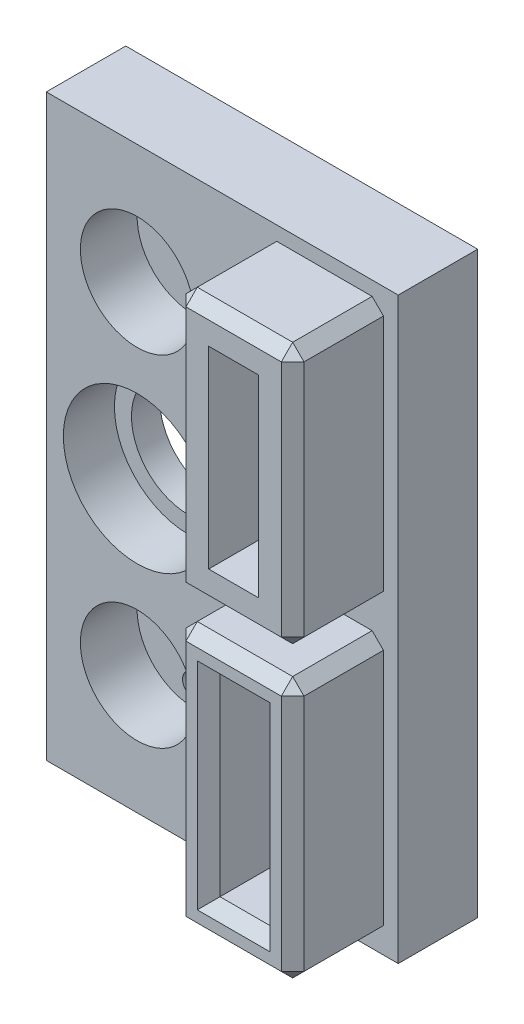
ISO-10303-21;
HEADER;
FILE_DESCRIPTION(('STEP AP214'),'2;1');
FILE_NAME('part.step','',(''),(''),'','','');
FILE_SCHEMA(('AUTOMOTIVE_DESIGN { 1 0 10303 214 1 1 1 1 }'));
ENDSEC;
DATA;
#1=APPLICATION_CONTEXT('core data for automotive mechanical design processes');
#2=APPLICATION_PROTOCOL_DEFINITION('international standard','automotive_design',2000,#1);
#3=PRODUCT_CONTEXT('',#1,'mechanical');
#4=PRODUCT('Part','Part','',(#3));
#5=PRODUCT_RELATED_PRODUCT_CATEGORY('part','',(#4));
#6=PRODUCT_DEFINITION_FORMATION('','',#4);
#7=PRODUCT_DEFINITION_CONTEXT('part definition',#1,'design');
#8=PRODUCT_DEFINITION('design','',#6,#7);
#9=PRODUCT_DEFINITION_SHAPE('','',#8);
#10=(LENGTH_UNIT() NAMED_UNIT(*) SI_UNIT(.MILLI.,.METRE.));
#11=(NAMED_UNIT(*) PLANE_ANGLE_UNIT() SI_UNIT($,.RADIAN.));
#12=(NAMED_UNIT(*) SI_UNIT($,.STERADIAN.) SOLID_ANGLE_UNIT());
#13=UNCERTAINTY_MEASURE_WITH_UNIT(LENGTH_MEASURE(1.E-05),#10,'distance_accuracy_value','');
#14=(GEOMETRIC_REPRESENTATION_CONTEXT(3) GLOBAL_UNCERTAINTY_ASSIGNED_CONTEXT((#13)) GLOBAL_UNIT_ASSIGNED_CONTEXT((#10,
#11,#12)) REPRESENTATION_CONTEXT('',''));
#15=CARTESIAN_POINT('',(0.,0.,0.));
#16=DIRECTION('',(0.,0.,1.));
#17=DIRECTION('',(1.,0.,0.));
#18=AXIS2_PLACEMENT_3D('',#15,#16,#17);
#19=CARTESIAN_POINT('',(0.,0.,5.));
#20=DIRECTION('',(0.,0.,1.));
#21=DIRECTION('',(1.,0.,0.));
#22=AXIS2_PLACEMENT_3D('',#19,#20,#21);
#23=PLANE('',#22);
#24=CARTESIAN_POINT('',(0.,0.,5.));
#25=DIRECTION('',(0.,0.,1.));
#26=DIRECTION('',(1.,0.,0.));
#27=AXIS2_PLACEMENT_3D('',#24,#25,#26);
#28=CIRCLE('',#27,6.5);
#29=CARTESIAN_POINT('',(6.5,0.,5.));
#30=VERTEX_POINT('',#29);
#31=EDGE_CURVE('E385',#30,#30,#28,.T.);
#32=ORIENTED_EDGE('',*,*,#31,.F.);
#33=EDGE_LOOP('',(#32));
#34=FACE_BOUND('',#33,.T.);
#35=CARTESIAN_POINT('',(0.,15.,5.));
#36=DIRECTION('',(0.,0.,1.));
#37=DIRECTION('',(1.,0.,0.));
#38=AXIS2_PLACEMENT_3D('',#35,#36,#37);
#39=CIRCLE('',#38,5.);
#40=CARTESIAN_POINT('',(5.00000000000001,15.,5.));
#41=VERTEX_POINT('',#40);
#42=EDGE_CURVE('E399',#41,#41,#39,.T.);
#43=ORIENTED_EDGE('',*,*,#42,.F.);
#44=EDGE_LOOP('',(#43));
#45=FACE_BOUND('',#44,.T.);
#46=CARTESIAN_POINT('',(0.,-15.,5.));
#47=DIRECTION('',(0.,0.,1.));
#48=DIRECTION('',(1.,0.,0.));
#49=AXIS2_PLACEMENT_3D('',#46,#47,#48);
#50=CIRCLE('',#49,5.);
#51=CARTESIAN_POINT('',(5.,-15.,5.));
#52=VERTEX_POINT('',#51);
#53=EDGE_CURVE('E405',#52,#52,#50,.T.);
#54=ORIENTED_EDGE('',*,*,#53,.F.);
#55=EDGE_LOOP('',(#54));
#56=FACE_BOUND('',#55,.T.);
#57=DIRECTION('',(0.,-1.,0.));
#58=VECTOR('',#57,1.);
#59=CARTESIAN_POINT('',(23.,25.68,5.));
#60=LINE('',#59,#58);
#61=CARTESIAN_POINT('',(23.,25.5,5.));
#62=VERTEX_POINT('',#61);
#63=CARTESIAN_POINT('',(23.,-25.5,5.));
#64=VERTEX_POINT('',#63);
#65=EDGE_CURVE('E367',#62,#64,#60,.T.);
#66=ORIENTED_EDGE('',*,*,#65,.F.);
#67=DIRECTION('',(-1.,0.,0.));
#68=VECTOR('',#67,1.);
#69=CARTESIAN_POINT('',(0.,25.5,5.));
#70=LINE('',#69,#68);
#71=CARTESIAN_POINT('',(-7.99999999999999,25.5,5.));
#72=VERTEX_POINT('',#71);
#73=EDGE_CURVE('E349',#62,#72,#70,.T.);
#74=ORIENTED_EDGE('',*,*,#73,.T.);
#75=DIRECTION('',(0.,-1.,0.));
#76=VECTOR('',#75,1.);
#77=CARTESIAN_POINT('',(-7.99999999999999,0.,5.));
#78=LINE('',#77,#76);
#79=CARTESIAN_POINT('',(-7.99999999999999,-25.5,5.));
#80=VERTEX_POINT('',#79);
#81=EDGE_CURVE('E402',#72,#80,#78,.T.);
#82=ORIENTED_EDGE('',*,*,#81,.T.);
#83=DIRECTION('',(1.,0.,0.));
#84=VECTOR('',#83,1.);
#85=CARTESIAN_POINT('',(0.,-25.5,5.));
#86=LINE('',#85,#84);
#87=EDGE_CURVE('E346',#80,#64,#86,.T.);
#88=ORIENTED_EDGE('',*,*,#87,.T.);
#89=EDGE_LOOP('',(#66,#74,#82,#88));
#90=FACE_BOUND('',#89,.T.);
#91=DIRECTION('',(-1.,0.,0.));
#92=VECTOR('',#91,1.);
#93=CARTESIAN_POINT('',(21.7,-1.25000000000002,5.));
#94=LINE('',#93,#92);
#95=CARTESIAN_POINT('',(20.7,-1.25000000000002,5.));
#96=VERTEX_POINT('',#95);
#97=CARTESIAN_POINT('',(12.3,-1.25000000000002,5.));
#98=VERTEX_POINT('',#97);
#99=EDGE_CURVE('E336',#96,#98,#94,.T.);
#100=ORIENTED_EDGE('',*,*,#99,.F.);
#101=DIRECTION('',(-0.70710678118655,0.707106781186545,0.));
#102=VECTOR('',#101,1.);
#103=CARTESIAN_POINT('',(20.7,-1.25000000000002,5.));
#104=LINE('',#103,#102);
#105=CARTESIAN_POINT('',(21.7,-2.25000000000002,5.));
#106=VERTEX_POINT('',#105);
#107=EDGE_CURVE('E507',#96,#106,#104,.F.);
#108=ORIENTED_EDGE('',*,*,#107,.T.);
#109=DIRECTION('',(0.,1.,0.));
#110=VECTOR('',#109,1.);
#111=CARTESIAN_POINT('',(21.7,-24.25,5.));
#112=LINE('',#111,#110);
#113=CARTESIAN_POINT('',(21.7,-23.25,5.));
#114=VERTEX_POINT('',#113);
#115=EDGE_CURVE('E333',#114,#106,#112,.T.);
#116=ORIENTED_EDGE('',*,*,#115,.F.);
#117=DIRECTION('',(0.70710678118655,0.707106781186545,0.));
#118=VECTOR('',#117,1.);
#119=CARTESIAN_POINT('',(21.7,-23.25,5.));
#120=LINE('',#119,#118);
#121=CARTESIAN_POINT('',(20.7,-24.25,5.));
#122=VERTEX_POINT('',#121);
#123=EDGE_CURVE('E505',#114,#122,#120,.F.);
#124=ORIENTED_EDGE('',*,*,#123,.T.);
#125=DIRECTION('',(1.,0.,0.));
#126=VECTOR('',#125,1.);
#127=CARTESIAN_POINT('',(21.7,-24.25,5.));
#128=LINE('',#127,#126);
#129=CARTESIAN_POINT('',(12.3,-24.25,5.));
#130=VERTEX_POINT('',#129);
#131=EDGE_CURVE('E342',#130,#122,#128,.T.);
#132=ORIENTED_EDGE('',*,*,#131,.F.);
#133=DIRECTION('',(0.70710678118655,-0.707106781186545,0.));
#134=VECTOR('',#133,1.);
#135=CARTESIAN_POINT('',(12.3,-24.25,5.));
#136=LINE('',#135,#134);
#137=CARTESIAN_POINT('',(11.3,-23.25,5.));
#138=VERTEX_POINT('',#137);
#139=EDGE_CURVE('E503',#130,#138,#136,.F.);
#140=ORIENTED_EDGE('',*,*,#139,.T.);
#141=DIRECTION('',(0.,-1.,0.));
#142=VECTOR('',#141,1.);
#143=CARTESIAN_POINT('',(11.3,-24.25,5.));
#144=LINE('',#143,#142);
#145=CARTESIAN_POINT('',(11.3,-2.25000000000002,5.));
#146=VERTEX_POINT('',#145);
#147=EDGE_CURVE('E339',#146,#138,#144,.T.);
#148=ORIENTED_EDGE('',*,*,#147,.F.);
#149=DIRECTION('',(-0.70710678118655,-0.707106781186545,0.));
#150=VECTOR('',#149,1.);
#151=CARTESIAN_POINT('',(11.3,-2.25000000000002,5.));
#152=LINE('',#151,#150);
#153=EDGE_CURVE('E509',#146,#98,#152,.F.);
#154=ORIENTED_EDGE('',*,*,#153,.T.);
#155=EDGE_LOOP('',(#100,#108,#116,#124,#132,#140,#148,#154));
#156=FACE_BOUND('',#155,.T.);
#157=DIRECTION('',(-1.,0.,0.));
#158=VECTOR('',#157,1.);
#159=CARTESIAN_POINT('',(21.7,24.25,5.));
#160=LINE('',#159,#158);
#161=CARTESIAN_POINT('',(20.7,24.25,5.));
#162=VERTEX_POINT('',#161);
#163=CARTESIAN_POINT('',(12.3,24.25,5.));
#164=VERTEX_POINT('',#163);
#165=EDGE_CURVE('E304',#162,#164,#160,.T.);
#166=ORIENTED_EDGE('',*,*,#165,.F.);
#167=DIRECTION('',(-0.707106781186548,0.707106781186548,0.));
#168=VECTOR('',#167,1.);
#169=CARTESIAN_POINT('',(20.7,24.25,5.));
#170=LINE('',#169,#168);
#171=CARTESIAN_POINT('',(21.7,23.25,5.));
#172=VERTEX_POINT('',#171);
#173=EDGE_CURVE('E11',#162,#172,#170,.F.);
#174=ORIENTED_EDGE('',*,*,#173,.T.);
#175=DIRECTION('',(0.,1.,0.));
#176=VECTOR('',#175,1.);
#177=CARTESIAN_POINT('',(21.7,1.24999999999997,5.));
#178=LINE('',#177,#176);
#179=CARTESIAN_POINT('',(21.7,2.24999999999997,5.));
#180=VERTEX_POINT('',#179);
#181=EDGE_CURVE('E279',#180,#172,#178,.T.);
#182=ORIENTED_EDGE('',*,*,#181,.F.);
#183=DIRECTION('',(0.707106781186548,0.707106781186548,0.));
#184=VECTOR('',#183,1.);
#185=CARTESIAN_POINT('',(21.7,2.24999999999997,5.));
#186=LINE('',#185,#184);
#187=CARTESIAN_POINT('',(20.7,1.24999999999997,5.));
#188=VERTEX_POINT('',#187);
#189=EDGE_CURVE('E46',#180,#188,#186,.F.);
#190=ORIENTED_EDGE('',*,*,#189,.T.);
#191=DIRECTION('',(1.,0.,0.));
#192=VECTOR('',#191,1.);
#193=CARTESIAN_POINT('',(21.7,1.24999999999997,5.));
#194=LINE('',#193,#192);
#195=CARTESIAN_POINT('',(12.3,1.24999999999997,5.));
#196=VERTEX_POINT('',#195);
#197=EDGE_CURVE('E310',#196,#188,#194,.T.);
#198=ORIENTED_EDGE('',*,*,#197,.F.);
#199=DIRECTION('',(0.707106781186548,-0.707106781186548,0.));
#200=VECTOR('',#199,1.);
#201=CARTESIAN_POINT('',(12.3,1.24999999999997,5.));
#202=LINE('',#201,#200);
#203=CARTESIAN_POINT('',(11.3,2.24999999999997,5.));
#204=VERTEX_POINT('',#203);
#205=EDGE_CURVE('E511',#196,#204,#202,.F.);
#206=ORIENTED_EDGE('',*,*,#205,.T.);
#207=DIRECTION('',(0.,-1.,0.));
#208=VECTOR('',#207,1.);
#209=CARTESIAN_POINT('',(11.3,1.24999999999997,5.));
#210=LINE('',#209,#208);
#211=CARTESIAN_POINT('',(11.3,23.25,5.));
#212=VERTEX_POINT('',#211);
#213=EDGE_CURVE('E307',#212,#204,#210,.T.);
#214=ORIENTED_EDGE('',*,*,#213,.F.);
#215=DIRECTION('',(-0.707106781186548,-0.707106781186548,0.));
#216=VECTOR('',#215,1.);
#217=CARTESIAN_POINT('',(11.3,23.25,5.));
#218=LINE('',#217,#216);
#219=EDGE_CURVE('E513',#212,#164,#218,.F.);
#220=ORIENTED_EDGE('',*,*,#219,.T.);
#221=EDGE_LOOP('',(#166,#174,#182,#190,#198,#206,#214,#220));
#222=FACE_BOUND('',#221,.T.);
#223=ADVANCED_FACE('F37',(#34,#45,#56,#90,#156,#222),#23,.T.);
#224=CARTESIAN_POINT('',(-7.99999999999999,0.,5.));
#225=DIRECTION('',(1.,0.,0.));
#226=DIRECTION('',(0.,0.,-1.));
#227=AXIS2_PLACEMENT_3D('',#224,#225,#226);
#228=PLANE('',#227);
#229=DIRECTION('',(0.,0.,1.));
#230=VECTOR('',#229,1.);
#231=CARTESIAN_POINT('',(-7.99999999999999,25.5,5.));
#232=LINE('',#231,#230);
#233=CARTESIAN_POINT('',(-7.99999999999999,25.5,-2.));
#234=VERTEX_POINT('',#233);
#235=EDGE_CURVE('E363',#234,#72,#232,.T.);
#236=ORIENTED_EDGE('',*,*,#235,.F.);
#237=DIRECTION('',(0.,1.,0.));
#238=VECTOR('',#237,1.);
#239=CARTESIAN_POINT('',(-7.99999999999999,25.8,-2.));
#240=LINE('',#239,#238);
#241=CARTESIAN_POINT('',(-7.99999999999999,-25.5,-2.));
#242=VERTEX_POINT('',#241);
#243=EDGE_CURVE('E395',#242,#234,#240,.T.);
#244=ORIENTED_EDGE('',*,*,#243,.F.);
#245=DIRECTION('',(0.,0.,1.));
#246=VECTOR('',#245,1.);
#247=CARTESIAN_POINT('',(-7.99999999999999,-25.5,-33.0005225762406));
#248=LINE('',#247,#246);
#249=EDGE_CURVE('E350',#242,#80,#248,.T.);
#250=ORIENTED_EDGE('',*,*,#249,.T.);
#251=ORIENTED_EDGE('',*,*,#81,.F.);
#252=EDGE_LOOP('',(#236,#244,#250,#251));
#253=FACE_BOUND('',#252,.T.);
#254=ADVANCED_FACE('F659',(#253),#228,.F.);
#255=CARTESIAN_POINT('',(0.,0.,-2.));
#256=DIRECTION('',(0.,0.,-1.));
#257=DIRECTION('',(-1.,0.,0.));
#258=AXIS2_PLACEMENT_3D('',#255,#256,#257);
#259=PLANE('',#258);
#260=CARTESIAN_POINT('',(0.,-18.3,-2.));
#261=DIRECTION('',(0.,0.,-1.));
#262=DIRECTION('',(-1.,0.,0.));
#263=AXIS2_PLACEMENT_3D('',#260,#261,#262);
#264=CIRCLE('',#263,1.);
#265=CARTESIAN_POINT('',(-1.,-18.3,-2.));
#266=VERTEX_POINT('',#265);
#267=EDGE_CURVE('E369',#266,#266,#264,.T.);
#268=ORIENTED_EDGE('',*,*,#267,.F.);
#269=EDGE_LOOP('',(#268));
#270=FACE_BOUND('',#269,.T.);
#271=CARTESIAN_POINT('',(0.,-15.,-2.));
#272=DIRECTION('',(0.,0.,-1.));
#273=DIRECTION('',(-1.,0.,0.));
#274=AXIS2_PLACEMENT_3D('',#271,#272,#273);
#275=CIRCLE('',#274,0.999999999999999);
#276=CARTESIAN_POINT('',(-0.999999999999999,-15.,-2.));
#277=VERTEX_POINT('',#276);
#278=EDGE_CURVE('E376',#277,#277,#275,.T.);
#279=ORIENTED_EDGE('',*,*,#278,.F.);
#280=EDGE_LOOP('',(#279));
#281=FACE_BOUND('',#280,.T.);
#282=CARTESIAN_POINT('',(0.,15.,-2.));
#283=DIRECTION('',(0.,0.,-1.));
#284=DIRECTION('',(-1.,0.,0.));
#285=AXIS2_PLACEMENT_3D('',#282,#283,#284);
#286=CIRCLE('',#285,1.);
#287=CARTESIAN_POINT('',(-0.99999999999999,15.,-2.));
#288=VERTEX_POINT('',#287);
#289=EDGE_CURVE('E382',#288,#288,#286,.T.);
#290=ORIENTED_EDGE('',*,*,#289,.F.);
#291=EDGE_LOOP('',(#290));
#292=FACE_BOUND('',#291,.T.);
#293=CARTESIAN_POINT('',(0.,0.,-2.));
#294=DIRECTION('',(0.,0.,-1.));
#295=DIRECTION('',(-1.,0.,0.));
#296=AXIS2_PLACEMENT_3D('',#293,#294,#295);
#297=CIRCLE('',#296,5.);
#298=CARTESIAN_POINT('',(-5.,0.,-2.));
#299=VERTEX_POINT('',#298);
#300=EDGE_CURVE('E392',#299,#299,#297,.T.);
#301=ORIENTED_EDGE('',*,*,#300,.F.);
#302=EDGE_LOOP('',(#301));
#303=FACE_BOUND('',#302,.T.);
#304=ORIENTED_EDGE('',*,*,#243,.T.);
#305=DIRECTION('',(1.,0.,0.));
#306=VECTOR('',#305,1.);
#307=CARTESIAN_POINT('',(0.,25.5,-2.));
#308=LINE('',#307,#306);
#309=CARTESIAN_POINT('',(23.,25.5,-2.));
#310=VERTEX_POINT('',#309);
#311=EDGE_CURVE('E360',#234,#310,#308,.T.);
#312=ORIENTED_EDGE('',*,*,#311,.T.);
#313=DIRECTION('',(0.,-1.,0.));
#314=VECTOR('',#313,1.);
#315=CARTESIAN_POINT('',(23.,25.68,-2.));
#316=LINE('',#315,#314);
#317=CARTESIAN_POINT('',(23.,-25.5,-2.));
#318=VERTEX_POINT('',#317);
#319=EDGE_CURVE('E365',#310,#318,#316,.T.);
#320=ORIENTED_EDGE('',*,*,#319,.T.);
#321=DIRECTION('',(1.,0.,0.));
#322=VECTOR('',#321,1.);
#323=CARTESIAN_POINT('',(0.,-25.5,-2.));
#324=LINE('',#323,#322);
#325=EDGE_CURVE('E345',#242,#318,#324,.T.);
#326=ORIENTED_EDGE('',*,*,#325,.F.);
#327=EDGE_LOOP('',(#304,#312,#320,#326));
#328=FACE_BOUND('',#327,.T.);
#329=ADVANCED_FACE('F667',(#270,#281,#292,#303,#328),#259,.T.);
#330=CARTESIAN_POINT('',(23.,25.68,56.0008245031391));
#331=DIRECTION('',(1.,0.,0.));
#332=DIRECTION('',(0.,0.,-1.));
#333=AXIS2_PLACEMENT_3D('',#330,#331,#332);
#334=PLANE('',#333);
#335=ORIENTED_EDGE('',*,*,#319,.F.);
#336=DIRECTION('',(0.,0.,1.));
#337=VECTOR('',#336,1.);
#338=CARTESIAN_POINT('',(23.,25.5,56.0008245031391));
#339=LINE('',#338,#337);
#340=EDGE_CURVE('E408',#310,#62,#339,.T.);
#341=ORIENTED_EDGE('',*,*,#340,.T.);
#342=ORIENTED_EDGE('',*,*,#65,.T.);
#343=DIRECTION('',(0.,0.,1.));
#344=VECTOR('',#343,1.);
#345=CARTESIAN_POINT('',(23.,-25.5,-33.0005225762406));
#346=LINE('',#345,#344);
#347=EDGE_CURVE('E353',#318,#64,#346,.T.);
#348=ORIENTED_EDGE('',*,*,#347,.F.);
#349=EDGE_LOOP('',(#335,#341,#342,#348));
#350=FACE_BOUND('',#349,.T.);
#351=ADVANCED_FACE('F1164',(#350),#334,.T.);
#352=CARTESIAN_POINT('',(0.,0.,0.6));
#353=DIRECTION('',(0.,0.,-1.));
#354=DIRECTION('',(-1.,0.,0.));
#355=AXIS2_PLACEMENT_3D('',#352,#353,#354);
#356=CYLINDRICAL_SURFACE('',#355,5.);
#357=ORIENTED_EDGE('',*,*,#300,.T.);
#358=EDGE_LOOP('',(#357));
#359=FACE_BOUND('',#358,.T.);
#360=CARTESIAN_POINT('',(0.,0.,0.5));
#361=DIRECTION('',(0.,0.,1.));
#362=DIRECTION('',(1.,0.,0.));
#363=AXIS2_PLACEMENT_3D('',#360,#361,#362);
#364=CIRCLE('',#363,5.);
#365=CARTESIAN_POINT('',(5.,0.,0.5));
#366=VERTEX_POINT('',#365);
#367=EDGE_CURVE('E389',#366,#366,#364,.F.);
#368=ORIENTED_EDGE('',*,*,#367,.F.);
#369=EDGE_LOOP('',(#368));
#370=FACE_BOUND('',#369,.T.);
#371=ADVANCED_FACE('F1170',(#359,#370),#356,.F.);
#372=CARTESIAN_POINT('',(0.,-15.,5.));
#373=DIRECTION('',(0.,0.,-1.));
#374=DIRECTION('',(-1.,0.,0.));
#375=AXIS2_PLACEMENT_3D('',#372,#373,#374);
#376=CYLINDRICAL_SURFACE('',#375,5.);
#377=ORIENTED_EDGE('',*,*,#53,.T.);
#378=EDGE_LOOP('',(#377));
#379=FACE_BOUND('',#378,.T.);
#380=CARTESIAN_POINT('',(0.,-15.,0.));
#381=DIRECTION('',(0.,0.,1.));
#382=DIRECTION('',(1.,0.,0.));
#383=AXIS2_PLACEMENT_3D('',#380,#381,#382);
#384=CIRCLE('',#383,5.);
#385=CARTESIAN_POINT('',(5.,-15.,0.));
#386=VERTEX_POINT('',#385);
#387=EDGE_CURVE('E403',#386,#386,#384,.T.);
#388=ORIENTED_EDGE('',*,*,#387,.F.);
#389=EDGE_LOOP('',(#388));
#390=FACE_BOUND('',#389,.T.);
#391=ADVANCED_FACE('F1293',(#379,#390),#376,.F.);
#392=CARTESIAN_POINT('',(0.,15.,5.));
#393=DIRECTION('',(0.,0.,-1.));
#394=DIRECTION('',(-1.,0.,0.));
#395=AXIS2_PLACEMENT_3D('',#392,#393,#394);
#396=CYLINDRICAL_SURFACE('',#395,5.);
#397=ORIENTED_EDGE('',*,*,#42,.T.);
#398=EDGE_LOOP('',(#397));
#399=FACE_BOUND('',#398,.T.);
#400=CARTESIAN_POINT('',(0.,15.,0.));
#401=DIRECTION('',(0.,0.,1.));
#402=DIRECTION('',(1.,0.,0.));
#403=AXIS2_PLACEMENT_3D('',#400,#401,#402);
#404=CIRCLE('',#403,5.);
#405=CARTESIAN_POINT('',(5.00000000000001,15.,0.));
#406=VERTEX_POINT('',#405);
#407=EDGE_CURVE('E398',#406,#406,#404,.T.);
#408=ORIENTED_EDGE('',*,*,#407,.F.);
#409=EDGE_LOOP('',(#408));
#410=FACE_BOUND('',#409,.T.);
#411=ADVANCED_FACE('F1268',(#399,#410),#396,.F.);
#412=CARTESIAN_POINT('',(0.,0.,0.));
#413=DIRECTION('',(0.,0.,-1.));
#414=DIRECTION('',(-1.,0.,0.));
#415=AXIS2_PLACEMENT_3D('',#412,#413,#414);
#416=PLANE('',#415);
#417=CARTESIAN_POINT('',(0.,15.,0.));
#418=DIRECTION('',(0.,0.,1.));
#419=DIRECTION('',(1.,0.,0.));
#420=AXIS2_PLACEMENT_3D('',#417,#418,#419);
#421=CIRCLE('',#420,1.);
#422=CARTESIAN_POINT('',(1.00000000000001,15.,0.));
#423=VERTEX_POINT('',#422);
#424=EDGE_CURVE('E379',#423,#423,#421,.T.);
#425=ORIENTED_EDGE('',*,*,#424,.F.);
#426=EDGE_LOOP('',(#425));
#427=FACE_BOUND('',#426,.T.);
#428=ORIENTED_EDGE('',*,*,#407,.T.);
#429=EDGE_LOOP('',(#428));
#430=FACE_BOUND('',#429,.T.);
#431=ADVANCED_FACE('F1237',(#427,#430),#416,.F.);
#432=CARTESIAN_POINT('',(0.,-18.3,0.));
#433=DIRECTION('',(0.,0.,-1.));
#434=DIRECTION('',(-1.,0.,0.));
#435=AXIS2_PLACEMENT_3D('',#432,#433,#434);
#436=CIRCLE('',#435,1.);
#437=CARTESIAN_POINT('',(-1.,-18.3,0.));
#438=VERTEX_POINT('',#437);
#439=EDGE_CURVE('E372',#438,#438,#436,.T.);
#440=ORIENTED_EDGE('',*,*,#439,.T.);
#441=EDGE_LOOP('',(#440));
#442=FACE_BOUND('',#441,.T.);
#443=CARTESIAN_POINT('',(0.,-15.,0.));
#444=DIRECTION('',(0.,0.,1.));
#445=DIRECTION('',(1.,0.,0.));
#446=AXIS2_PLACEMENT_3D('',#443,#444,#445);
#447=CIRCLE('',#446,0.999999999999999);
#448=CARTESIAN_POINT('',(0.999999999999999,-15.,0.));
#449=VERTEX_POINT('',#448);
#450=EDGE_CURVE('E373',#449,#449,#447,.T.);
#451=ORIENTED_EDGE('',*,*,#450,.F.);
#452=EDGE_LOOP('',(#451));
#453=FACE_BOUND('',#452,.T.);
#454=ORIENTED_EDGE('',*,*,#387,.T.);
#455=EDGE_LOOP('',(#454));
#456=FACE_BOUND('',#455,.T.);
#457=ADVANCED_FACE('F1231',(#442,#453,#456),#416,.F.);
#458=CARTESIAN_POINT('',(0.,0.,0.5));
#459=DIRECTION('',(0.,0.,1.));
#460=DIRECTION('',(1.,0.,0.));
#461=AXIS2_PLACEMENT_3D('',#458,#459,#460);
#462=PLANE('',#461);
#463=CARTESIAN_POINT('',(0.,0.,0.5));
#464=DIRECTION('',(0.,0.,1.));
#465=DIRECTION('',(1.,0.,0.));
#466=AXIS2_PLACEMENT_3D('',#463,#464,#465);
#467=CIRCLE('',#466,6.5);
#468=CARTESIAN_POINT('',(6.5,0.,0.5));
#469=VERTEX_POINT('',#468);
#470=EDGE_CURVE('E386',#469,#469,#467,.T.);
#471=ORIENTED_EDGE('',*,*,#470,.T.);
#472=EDGE_LOOP('',(#471));
#473=FACE_BOUND('',#472,.T.);
#474=ORIENTED_EDGE('',*,*,#367,.T.);
#475=EDGE_LOOP('',(#474));
#476=FACE_BOUND('',#475,.T.);
#477=ADVANCED_FACE('F1236',(#473,#476),#462,.T.);
#478=CARTESIAN_POINT('',(0.,0.,0.5));
#479=DIRECTION('',(0.,0.,1.));
#480=DIRECTION('',(1.,0.,0.));
#481=AXIS2_PLACEMENT_3D('',#478,#479,#480);
#482=CYLINDRICAL_SURFACE('',#481,6.5);
#483=ORIENTED_EDGE('',*,*,#470,.F.);
#484=EDGE_LOOP('',(#483));
#485=FACE_BOUND('',#484,.T.);
#486=ORIENTED_EDGE('',*,*,#31,.T.);
#487=EDGE_LOOP('',(#486));
#488=FACE_BOUND('',#487,.T.);
#489=ADVANCED_FACE('F1258',(#485,#488),#482,.F.);
#490=CARTESIAN_POINT('',(0.,15.,-10.));
#491=DIRECTION('',(0.,0.,1.));
#492=DIRECTION('',(1.,0.,0.));
#493=AXIS2_PLACEMENT_3D('',#490,#491,#492);
#494=CYLINDRICAL_SURFACE('',#493,1.);
#495=ORIENTED_EDGE('',*,*,#289,.T.);
#496=EDGE_LOOP('',(#495));
#497=FACE_BOUND('',#496,.T.);
#498=ORIENTED_EDGE('',*,*,#424,.T.);
#499=EDGE_LOOP('',(#498));
#500=FACE_BOUND('',#499,.T.);
#501=ADVANCED_FACE('F1248',(#497,#500),#494,.F.);
#502=CARTESIAN_POINT('',(0.,-15.,-10.));
#503=DIRECTION('',(0.,0.,1.));
#504=DIRECTION('',(1.,0.,0.));
#505=AXIS2_PLACEMENT_3D('',#502,#503,#504);
#506=CYLINDRICAL_SURFACE('',#505,0.999999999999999);
#507=ORIENTED_EDGE('',*,*,#278,.T.);
#508=EDGE_LOOP('',(#507));
#509=FACE_BOUND('',#508,.T.);
#510=ORIENTED_EDGE('',*,*,#450,.T.);
#511=EDGE_LOOP('',(#510));
#512=FACE_BOUND('',#511,.T.);
#513=ADVANCED_FACE('F1223',(#509,#512),#506,.F.);
#514=CARTESIAN_POINT('',(0.,-18.3,9.));
#515=DIRECTION('',(0.,0.,-1.));
#516=DIRECTION('',(-1.,0.,0.));
#517=AXIS2_PLACEMENT_3D('',#514,#515,#516);
#518=CYLINDRICAL_SURFACE('',#517,1.);
#519=ORIENTED_EDGE('',*,*,#267,.T.);
#520=EDGE_LOOP('',(#519));
#521=FACE_BOUND('',#520,.T.);
#522=ORIENTED_EDGE('',*,*,#439,.F.);
#523=EDGE_LOOP('',(#522));
#524=FACE_BOUND('',#523,.T.);
#525=ADVANCED_FACE('F1212',(#521,#524),#518,.F.);
#526=CARTESIAN_POINT('',(0.,25.5,-5.));
#527=DIRECTION('',(0.,1.,0.));
#528=DIRECTION('',(0.,0.,1.));
#529=AXIS2_PLACEMENT_3D('',#526,#527,#528);
#530=PLANE('',#529);
#531=ORIENTED_EDGE('',*,*,#235,.T.);
#532=ORIENTED_EDGE('',*,*,#73,.F.);
#533=ORIENTED_EDGE('',*,*,#340,.F.);
#534=ORIENTED_EDGE('',*,*,#311,.F.);
#535=EDGE_LOOP('',(#531,#532,#533,#534));
#536=FACE_BOUND('',#535,.T.);
#537=ADVANCED_FACE('F1159',(#536),#530,.T.);
#538=CARTESIAN_POINT('',(0.,-25.5,-33.0005225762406));
#539=DIRECTION('',(0.,-1.,0.));
#540=DIRECTION('',(0.,0.,-1.));
#541=AXIS2_PLACEMENT_3D('',#538,#539,#540);
#542=PLANE('',#541);
#543=ORIENTED_EDGE('',*,*,#249,.F.);
#544=ORIENTED_EDGE('',*,*,#325,.T.);
#545=ORIENTED_EDGE('',*,*,#347,.T.);
#546=ORIENTED_EDGE('',*,*,#87,.F.);
#547=EDGE_LOOP('',(#543,#544,#545,#546));
#548=FACE_BOUND('',#547,.T.);
#549=ADVANCED_FACE('F726',(#548),#542,.T.);
#550=CARTESIAN_POINT('',(0.,0.,13.));
#551=DIRECTION('',(0.,0.,1.));
#552=DIRECTION('',(1.,0.,0.));
#553=AXIS2_PLACEMENT_3D('',#550,#551,#552);
#554=PLANE('',#553);
#555=DIRECTION('',(-1.,0.,0.));
#556=VECTOR('',#555,1.);
#557=CARTESIAN_POINT('',(0.,-22.25,13.));
#558=LINE('',#557,#556);
#559=CARTESIAN_POINT('',(19.7,-22.25,13.));
#560=VERTEX_POINT('',#559);
#561=CARTESIAN_POINT('',(13.3,-22.25,13.));
#562=VERTEX_POINT('',#561);
#563=EDGE_CURVE('E435',#560,#562,#558,.T.);
#564=ORIENTED_EDGE('',*,*,#563,.T.);
#565=DIRECTION('',(0.,1.,0.));
#566=VECTOR('',#565,1.);
#567=CARTESIAN_POINT('',(13.3,0.,13.));
#568=LINE('',#567,#566);
#569=CARTESIAN_POINT('',(13.3,-3.25000000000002,13.));
#570=VERTEX_POINT('',#569);
#571=EDGE_CURVE('E437',#562,#570,#568,.T.);
#572=ORIENTED_EDGE('',*,*,#571,.T.);
#573=DIRECTION('',(1.,0.,0.));
#574=VECTOR('',#573,1.);
#575=CARTESIAN_POINT('',(0.,-3.25000000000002,13.));
#576=LINE('',#575,#574);
#577=CARTESIAN_POINT('',(19.7,-3.25000000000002,13.));
#578=VERTEX_POINT('',#577);
#579=EDGE_CURVE('E431',#570,#578,#576,.T.);
#580=ORIENTED_EDGE('',*,*,#579,.T.);
#581=DIRECTION('',(0.,-1.,0.));
#582=VECTOR('',#581,1.);
#583=CARTESIAN_POINT('',(19.7,0.,13.));
#584=LINE('',#583,#582);
#585=EDGE_CURVE('E433',#578,#560,#584,.T.);
#586=ORIENTED_EDGE('',*,*,#585,.T.);
#587=EDGE_LOOP('',(#564,#572,#580,#586));
#588=FACE_BOUND('',#587,.T.);
#589=DIRECTION('',(0.,-1.,0.));
#590=VECTOR('',#589,1.);
#591=CARTESIAN_POINT('',(12.3,-24.25,13.));
#592=LINE('',#591,#590);
#593=CARTESIAN_POINT('',(12.3,-2.25000000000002,13.));
#594=VERTEX_POINT('',#593);
#595=CARTESIAN_POINT('',(12.3,-23.25,13.));
#596=VERTEX_POINT('',#595);
#597=EDGE_CURVE('E426',#594,#596,#592,.T.);
#598=ORIENTED_EDGE('',*,*,#597,.T.);
#599=DIRECTION('',(1.,0.,0.));
#600=VECTOR('',#599,1.);
#601=CARTESIAN_POINT('',(21.7,-23.25,13.));
#602=LINE('',#601,#600);
#603=CARTESIAN_POINT('',(20.7,-23.25,13.));
#604=VERTEX_POINT('',#603);
#605=EDGE_CURVE('E428',#596,#604,#602,.T.);
#606=ORIENTED_EDGE('',*,*,#605,.T.);
#607=DIRECTION('',(0.,1.,0.));
#608=VECTOR('',#607,1.);
#609=CARTESIAN_POINT('',(20.7,-1.25000000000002,13.));
#610=LINE('',#609,#608);
#611=CARTESIAN_POINT('',(20.7,-2.25000000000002,13.));
#612=VERTEX_POINT('',#611);
#613=EDGE_CURVE('E424',#604,#612,#610,.T.);
#614=ORIENTED_EDGE('',*,*,#613,.T.);
#615=DIRECTION('',(-1.,0.,0.));
#616=VECTOR('',#615,1.);
#617=CARTESIAN_POINT('',(11.3,-2.25000000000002,13.));
#618=LINE('',#617,#616);
#619=EDGE_CURVE('E422',#612,#594,#618,.T.);
#620=ORIENTED_EDGE('',*,*,#619,.T.);
#621=EDGE_LOOP('',(#598,#606,#614,#620));
#622=FACE_BOUND('',#621,.T.);
#623=ADVANCED_FACE('F722',(#588,#622),#554,.T.);
#624=CARTESIAN_POINT('',(21.7,-24.25,13.));
#625=DIRECTION('',(-1.,0.,0.));
#626=DIRECTION('',(0.,0.,1.));
#627=AXIS2_PLACEMENT_3D('',#624,#625,#626);
#628=PLANE('',#627);
#629=DIRECTION('',(0.,-1.,0.));
#630=VECTOR('',#629,1.);
#631=CARTESIAN_POINT('',(21.7,-24.25,12.));
#632=LINE('',#631,#630);
#633=CARTESIAN_POINT('',(21.7,-2.25000000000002,12.));
#634=VERTEX_POINT('',#633);
#635=CARTESIAN_POINT('',(21.7,-23.25,12.));
#636=VERTEX_POINT('',#635);
#637=EDGE_CURVE('E461',#634,#636,#632,.T.);
#638=ORIENTED_EDGE('',*,*,#637,.T.);
#639=DIRECTION('',(0.,0.,-1.));
#640=VECTOR('',#639,1.);
#641=CARTESIAN_POINT('',(21.7,-23.25,13.));
#642=LINE('',#641,#640);
#643=EDGE_CURVE('E463',#636,#114,#642,.T.);
#644=ORIENTED_EDGE('',*,*,#643,.T.);
#645=ORIENTED_EDGE('',*,*,#115,.T.);
#646=DIRECTION('',(0.,0.,1.));
#647=VECTOR('',#646,1.);
#648=CARTESIAN_POINT('',(21.7,-2.25000000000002,13.));
#649=LINE('',#648,#647);
#650=EDGE_CURVE('E459',#106,#634,#649,.T.);
#651=ORIENTED_EDGE('',*,*,#650,.T.);
#652=EDGE_LOOP('',(#638,#644,#645,#651));
#653=FACE_BOUND('',#652,.T.);
#654=ADVANCED_FACE('F725',(#653),#628,.F.);
#655=CARTESIAN_POINT('',(21.7,-1.25000000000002,13.));
#656=DIRECTION('',(0.,-1.,0.));
#657=DIRECTION('',(0.,0.,-1.));
#658=AXIS2_PLACEMENT_3D('',#655,#656,#657);
#659=PLANE('',#658);
#660=DIRECTION('',(1.,0.,0.));
#661=VECTOR('',#660,1.);
#662=CARTESIAN_POINT('',(21.7,-1.25000000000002,12.));
#663=LINE('',#662,#661);
#664=CARTESIAN_POINT('',(12.3,-1.25000000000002,12.));
#665=VERTEX_POINT('',#664);
#666=CARTESIAN_POINT('',(20.7,-1.25000000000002,12.));
#667=VERTEX_POINT('',#666);
#668=EDGE_CURVE('E467',#665,#667,#663,.T.);
#669=ORIENTED_EDGE('',*,*,#668,.T.);
#670=DIRECTION('',(0.,0.,-1.));
#671=VECTOR('',#670,1.);
#672=CARTESIAN_POINT('',(20.7,-1.25000000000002,13.));
#673=LINE('',#672,#671);
#674=EDGE_CURVE('E469',#667,#96,#673,.T.);
#675=ORIENTED_EDGE('',*,*,#674,.T.);
#676=ORIENTED_EDGE('',*,*,#99,.T.);
#677=DIRECTION('',(0.,0.,1.));
#678=VECTOR('',#677,1.);
#679=CARTESIAN_POINT('',(12.3,-1.25000000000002,13.));
#680=LINE('',#679,#678);
#681=EDGE_CURVE('E465',#98,#665,#680,.T.);
#682=ORIENTED_EDGE('',*,*,#681,.T.);
#683=EDGE_LOOP('',(#669,#675,#676,#682));
#684=FACE_BOUND('',#683,.T.);
#685=ADVANCED_FACE('F766',(#684),#659,.F.);
#686=CARTESIAN_POINT('',(11.3,-24.25,13.));
#687=DIRECTION('',(1.,0.,0.));
#688=DIRECTION('',(0.,0.,-1.));
#689=AXIS2_PLACEMENT_3D('',#686,#687,#688);
#690=PLANE('',#689);
#691=ORIENTED_EDGE('',*,*,#147,.T.);
#692=DIRECTION('',(0.,0.,1.));
#693=VECTOR('',#692,1.);
#694=CARTESIAN_POINT('',(11.3,-23.25,13.));
#695=LINE('',#694,#693);
#696=CARTESIAN_POINT('',(11.3,-23.25,12.));
#697=VERTEX_POINT('',#696);
#698=EDGE_CURVE('E457',#138,#697,#695,.T.);
#699=ORIENTED_EDGE('',*,*,#698,.T.);
#700=DIRECTION('',(0.,1.,0.));
#701=VECTOR('',#700,1.);
#702=CARTESIAN_POINT('',(11.3,-1.25000000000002,12.));
#703=LINE('',#702,#701);
#704=CARTESIAN_POINT('',(11.3,-2.25000000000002,12.));
#705=VERTEX_POINT('',#704);
#706=EDGE_CURVE('E455',#697,#705,#703,.T.);
#707=ORIENTED_EDGE('',*,*,#706,.T.);
#708=DIRECTION('',(0.,0.,-1.));
#709=VECTOR('',#708,1.);
#710=CARTESIAN_POINT('',(11.3,-2.25000000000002,13.));
#711=LINE('',#710,#709);
#712=EDGE_CURVE('E453',#705,#146,#711,.T.);
#713=ORIENTED_EDGE('',*,*,#712,.T.);
#714=EDGE_LOOP('',(#691,#699,#707,#713));
#715=FACE_BOUND('',#714,.T.);
#716=ADVANCED_FACE('F1085',(#715),#690,.F.);
#717=CARTESIAN_POINT('',(21.7,-24.25,13.));
#718=DIRECTION('',(0.,1.,0.));
#719=DIRECTION('',(0.,0.,1.));
#720=AXIS2_PLACEMENT_3D('',#717,#718,#719);
#721=PLANE('',#720);
#722=DIRECTION('',(-1.,0.,0.));
#723=VECTOR('',#722,1.);
#724=CARTESIAN_POINT('',(11.3,-24.25,12.));
#725=LINE('',#724,#723);
#726=CARTESIAN_POINT('',(20.7,-24.25,12.));
#727=VERTEX_POINT('',#726);
#728=CARTESIAN_POINT('',(12.3,-24.25,12.));
#729=VERTEX_POINT('',#728);
#730=EDGE_CURVE('E448',#727,#729,#725,.T.);
#731=ORIENTED_EDGE('',*,*,#730,.T.);
#732=DIRECTION('',(0.,0.,-1.));
#733=VECTOR('',#732,1.);
#734=CARTESIAN_POINT('',(12.3,-24.25,13.));
#735=LINE('',#734,#733);
#736=EDGE_CURVE('E451',#729,#130,#735,.T.);
#737=ORIENTED_EDGE('',*,*,#736,.T.);
#738=ORIENTED_EDGE('',*,*,#131,.T.);
#739=DIRECTION('',(0.,0.,1.));
#740=VECTOR('',#739,1.);
#741=CARTESIAN_POINT('',(20.7,-24.25,13.));
#742=LINE('',#741,#740);
#743=EDGE_CURVE('E446',#122,#727,#742,.T.);
#744=ORIENTED_EDGE('',*,*,#743,.T.);
#745=EDGE_LOOP('',(#731,#737,#738,#744));
#746=FACE_BOUND('',#745,.T.);
#747=ADVANCED_FACE('F1077',(#746),#721,.F.);
#748=CARTESIAN_POINT('',(18.7,-21.25,13.));
#749=DIRECTION('',(-1.,0.,0.));
#750=DIRECTION('',(0.,0.,1.));
#751=AXIS2_PLACEMENT_3D('',#748,#749,#750);
#752=PLANE('',#751);
#753=DIRECTION('',(0.,0.,-1.));
#754=VECTOR('',#753,1.);
#755=CARTESIAN_POINT('',(18.7,-21.25,13.));
#756=LINE('',#755,#754);
#757=CARTESIAN_POINT('',(18.7,-21.25,12.));
#758=VERTEX_POINT('',#757);
#759=CARTESIAN_POINT('',(18.7,-21.25,5.));
#760=VERTEX_POINT('',#759);
#761=EDGE_CURVE('E325',#758,#760,#756,.T.);
#762=ORIENTED_EDGE('',*,*,#761,.F.);
#763=DIRECTION('',(0.,1.,0.));
#764=VECTOR('',#763,1.);
#765=CARTESIAN_POINT('',(18.7,-21.25,12.));
#766=LINE('',#765,#764);
#767=CARTESIAN_POINT('',(18.7,-4.25000000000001,12.));
#768=VERTEX_POINT('',#767);
#769=EDGE_CURVE('E442',#758,#768,#766,.T.);
#770=ORIENTED_EDGE('',*,*,#769,.T.);
#771=DIRECTION('',(0.,0.,-1.));
#772=VECTOR('',#771,1.);
#773=CARTESIAN_POINT('',(18.7,-4.25000000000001,13.));
#774=LINE('',#773,#772);
#775=CARTESIAN_POINT('',(18.7,-4.25000000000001,5.));
#776=VERTEX_POINT('',#775);
#777=EDGE_CURVE('E331',#768,#776,#774,.T.);
#778=ORIENTED_EDGE('',*,*,#777,.T.);
#779=DIRECTION('',(0.,1.,0.));
#780=VECTOR('',#779,1.);
#781=CARTESIAN_POINT('',(18.7,-21.25,5.));
#782=LINE('',#781,#780);
#783=EDGE_CURVE('E313',#760,#776,#782,.T.);
#784=ORIENTED_EDGE('',*,*,#783,.F.);
#785=EDGE_LOOP('',(#762,#770,#778,#784));
#786=FACE_BOUND('',#785,.T.);
#787=ADVANCED_FACE('F718',(#786),#752,.T.);
#788=CARTESIAN_POINT('',(18.7,-4.25000000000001,13.));
#789=DIRECTION('',(0.,-1.,0.));
#790=DIRECTION('',(1.,0.,0.));
#791=AXIS2_PLACEMENT_3D('',#788,#789,#790);
#792=PLANE('',#791);
#793=ORIENTED_EDGE('',*,*,#777,.F.);
#794=DIRECTION('',(-1.,0.,0.));
#795=VECTOR('',#794,1.);
#796=CARTESIAN_POINT('',(18.7,-4.25000000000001,12.));
#797=LINE('',#796,#795);
#798=CARTESIAN_POINT('',(14.3,-4.25000000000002,12.));
#799=VERTEX_POINT('',#798);
#800=EDGE_CURVE('E444',#768,#799,#797,.T.);
#801=ORIENTED_EDGE('',*,*,#800,.T.);
#802=DIRECTION('',(0.,0.,-1.));
#803=VECTOR('',#802,1.);
#804=CARTESIAN_POINT('',(14.3,-4.25000000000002,13.));
#805=LINE('',#804,#803);
#806=CARTESIAN_POINT('',(14.3,-4.25000000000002,5.));
#807=VERTEX_POINT('',#806);
#808=EDGE_CURVE('E329',#799,#807,#805,.T.);
#809=ORIENTED_EDGE('',*,*,#808,.T.);
#810=DIRECTION('',(-1.,0.,0.));
#811=VECTOR('',#810,1.);
#812=CARTESIAN_POINT('',(18.7,-4.25000000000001,5.));
#813=LINE('',#812,#811);
#814=EDGE_CURVE('E316',#776,#807,#813,.T.);
#815=ORIENTED_EDGE('',*,*,#814,.F.);
#816=EDGE_LOOP('',(#793,#801,#809,#815));
#817=FACE_BOUND('',#816,.T.);
#818=ADVANCED_FACE('F697',(#817),#792,.T.);
#819=CARTESIAN_POINT('',(14.3,-21.25,13.));
#820=DIRECTION('',(1.,0.,0.));
#821=DIRECTION('',(0.,0.,-1.));
#822=AXIS2_PLACEMENT_3D('',#819,#820,#821);
#823=PLANE('',#822);
#824=ORIENTED_EDGE('',*,*,#808,.F.);
#825=DIRECTION('',(0.,-1.,0.));
#826=VECTOR('',#825,1.);
#827=CARTESIAN_POINT('',(14.3,-21.25,12.));
#828=LINE('',#827,#826);
#829=CARTESIAN_POINT('',(14.3,-21.25,12.));
#830=VERTEX_POINT('',#829);
#831=EDGE_CURVE('E419',#799,#830,#828,.T.);
#832=ORIENTED_EDGE('',*,*,#831,.T.);
#833=DIRECTION('',(0.,0.,-1.));
#834=VECTOR('',#833,1.);
#835=CARTESIAN_POINT('',(14.3,-21.25,13.));
#836=LINE('',#835,#834);
#837=CARTESIAN_POINT('',(14.3,-21.25,5.));
#838=VERTEX_POINT('',#837);
#839=EDGE_CURVE('E327',#830,#838,#836,.T.);
#840=ORIENTED_EDGE('',*,*,#839,.T.);
#841=DIRECTION('',(0.,-1.,0.));
#842=VECTOR('',#841,1.);
#843=CARTESIAN_POINT('',(14.3,-21.25,5.));
#844=LINE('',#843,#842);
#845=EDGE_CURVE('E319',#807,#838,#844,.T.);
#846=ORIENTED_EDGE('',*,*,#845,.F.);
#847=EDGE_LOOP('',(#824,#832,#840,#846));
#848=FACE_BOUND('',#847,.T.);
#849=ADVANCED_FACE('F686',(#848),#823,.T.);
#850=CARTESIAN_POINT('',(18.7,-21.25,13.));
#851=DIRECTION('',(0.,1.,0.));
#852=DIRECTION('',(0.,0.,1.));
#853=AXIS2_PLACEMENT_3D('',#850,#851,#852);
#854=PLANE('',#853);
#855=ORIENTED_EDGE('',*,*,#839,.F.);
#856=DIRECTION('',(1.,0.,0.));
#857=VECTOR('',#856,1.);
#858=CARTESIAN_POINT('',(18.7,-21.25,12.));
#859=LINE('',#858,#857);
#860=EDGE_CURVE('E440',#830,#758,#859,.T.);
#861=ORIENTED_EDGE('',*,*,#860,.T.);
#862=ORIENTED_EDGE('',*,*,#761,.T.);
#863=DIRECTION('',(1.,0.,0.));
#864=VECTOR('',#863,1.);
#865=CARTESIAN_POINT('',(18.7,-21.25,5.));
#866=LINE('',#865,#864);
#867=EDGE_CURVE('E322',#838,#760,#866,.T.);
#868=ORIENTED_EDGE('',*,*,#867,.F.);
#869=EDGE_LOOP('',(#855,#861,#862,#868));
#870=FACE_BOUND('',#869,.T.);
#871=ADVANCED_FACE('F679',(#870),#854,.T.);
#872=ORIENTED_EDGE('',*,*,#783,.T.);
#873=ORIENTED_EDGE('',*,*,#814,.T.);
#874=ORIENTED_EDGE('',*,*,#845,.T.);
#875=ORIENTED_EDGE('',*,*,#867,.T.);
#876=EDGE_LOOP('',(#872,#873,#874,#875));
#877=FACE_BOUND('',#876,.T.);
#878=ADVANCED_FACE('F663',(#877),#23,.T.);
#879=CARTESIAN_POINT('',(0.,0.,13.));
#880=DIRECTION('',(0.,0.,1.));
#881=DIRECTION('',(1.,0.,0.));
#882=AXIS2_PLACEMENT_3D('',#879,#880,#881);
#883=PLANE('',#882);
#884=DIRECTION('',(0.,-1.,0.));
#885=VECTOR('',#884,1.);
#886=CARTESIAN_POINT('',(12.3,1.24999999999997,13.));
#887=LINE('',#886,#885);
#888=CARTESIAN_POINT('',(12.3,23.25,13.));
#889=VERTEX_POINT('',#888);
#890=CARTESIAN_POINT('',(12.3,2.24999999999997,13.));
#891=VERTEX_POINT('',#890);
#892=EDGE_CURVE('E475',#889,#891,#887,.T.);
#893=ORIENTED_EDGE('',*,*,#892,.T.);
#894=DIRECTION('',(1.,0.,0.));
#895=VECTOR('',#894,1.);
#896=CARTESIAN_POINT('',(21.7,2.24999999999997,13.));
#897=LINE('',#896,#895);
#898=CARTESIAN_POINT('',(20.7,2.24999999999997,13.));
#899=VERTEX_POINT('',#898);
#900=EDGE_CURVE('E477',#891,#899,#897,.T.);
#901=ORIENTED_EDGE('',*,*,#900,.T.);
#902=DIRECTION('',(0.,1.,0.));
#903=VECTOR('',#902,1.);
#904=CARTESIAN_POINT('',(20.7,24.25,13.));
#905=LINE('',#904,#903);
#906=CARTESIAN_POINT('',(20.7,23.25,13.));
#907=VERTEX_POINT('',#906);
#908=EDGE_CURVE('E471',#899,#907,#905,.T.);
#909=ORIENTED_EDGE('',*,*,#908,.T.);
#910=DIRECTION('',(-1.,0.,0.));
#911=VECTOR('',#910,1.);
#912=CARTESIAN_POINT('',(11.3,23.25,13.));
#913=LINE('',#912,#911);
#914=EDGE_CURVE('E473',#907,#889,#913,.T.);
#915=ORIENTED_EDGE('',*,*,#914,.T.);
#916=EDGE_LOOP('',(#893,#901,#909,#915));
#917=FACE_BOUND('',#916,.T.);
#918=DIRECTION('',(-1.,0.,0.));
#919=VECTOR('',#918,1.);
#920=CARTESIAN_POINT('',(18.7,21.25,13.));
#921=LINE('',#920,#919);
#922=CARTESIAN_POINT('',(18.7,21.25,13.));
#923=VERTEX_POINT('',#922);
#924=CARTESIAN_POINT('',(14.3,21.25,13.));
#925=VERTEX_POINT('',#924);
#926=EDGE_CURVE('E270',#923,#925,#921,.T.);
#927=ORIENTED_EDGE('',*,*,#926,.F.);
#928=DIRECTION('',(0.,1.,0.));
#929=VECTOR('',#928,1.);
#930=CARTESIAN_POINT('',(18.7,4.24999999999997,13.));
#931=LINE('',#930,#929);
#932=CARTESIAN_POINT('',(18.7,4.24999999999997,13.));
#933=VERTEX_POINT('',#932);
#934=EDGE_CURVE('E260',#933,#923,#931,.T.);
#935=ORIENTED_EDGE('',*,*,#934,.F.);
#936=DIRECTION('',(1.,0.,0.));
#937=VECTOR('',#936,1.);
#938=CARTESIAN_POINT('',(18.7,4.24999999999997,13.));
#939=LINE('',#938,#937);
#940=CARTESIAN_POINT('',(14.3,4.24999999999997,13.));
#941=VERTEX_POINT('',#940);
#942=EDGE_CURVE('E287',#941,#933,#939,.T.);
#943=ORIENTED_EDGE('',*,*,#942,.F.);
#944=DIRECTION('',(0.,-1.,0.));
#945=VECTOR('',#944,1.);
#946=CARTESIAN_POINT('',(14.3,4.24999999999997,13.));
#947=LINE('',#946,#945);
#948=EDGE_CURVE('E285',#925,#941,#947,.T.);
#949=ORIENTED_EDGE('',*,*,#948,.F.);
#950=EDGE_LOOP('',(#927,#935,#943,#949));
#951=FACE_BOUND('',#950,.T.);
#952=ADVANCED_FACE('F283',(#917,#951),#883,.T.);
#953=CARTESIAN_POINT('',(21.7,1.24999999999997,13.));
#954=DIRECTION('',(-1.,0.,0.));
#955=DIRECTION('',(0.,0.,1.));
#956=AXIS2_PLACEMENT_3D('',#953,#954,#955);
#957=PLANE('',#956);
#958=DIRECTION('',(0.,-1.,0.));
#959=VECTOR('',#958,1.);
#960=CARTESIAN_POINT('',(21.7,1.24999999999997,12.));
#961=LINE('',#960,#959);
#962=CARTESIAN_POINT('',(21.7,23.25,12.));
#963=VERTEX_POINT('',#962);
#964=CARTESIAN_POINT('',(21.7,2.24999999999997,12.));
#965=VERTEX_POINT('',#964);
#966=EDGE_CURVE('E54',#963,#965,#961,.T.);
#967=ORIENTED_EDGE('',*,*,#966,.T.);
#968=DIRECTION('',(0.,0.,-1.));
#969=VECTOR('',#968,1.);
#970=CARTESIAN_POINT('',(21.7,2.24999999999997,13.));
#971=LINE('',#970,#969);
#972=EDGE_CURVE('E501',#965,#180,#971,.T.);
#973=ORIENTED_EDGE('',*,*,#972,.T.);
#974=ORIENTED_EDGE('',*,*,#181,.T.);
#975=DIRECTION('',(0.,0.,1.));
#976=VECTOR('',#975,1.);
#977=CARTESIAN_POINT('',(21.7,23.25,13.));
#978=LINE('',#977,#976);
#979=EDGE_CURVE('E59',#172,#963,#978,.T.);
#980=ORIENTED_EDGE('',*,*,#979,.T.);
#981=EDGE_LOOP('',(#967,#973,#974,#980));
#982=FACE_BOUND('',#981,.T.);
#983=ADVANCED_FACE('F623',(#982),#957,.F.);
#984=CARTESIAN_POINT('',(21.7,24.25,13.));
#985=DIRECTION('',(0.,-1.,0.));
#986=DIRECTION('',(0.,0.,-1.));
#987=AXIS2_PLACEMENT_3D('',#984,#985,#986);
#988=PLANE('',#987);
#989=ORIENTED_EDGE('',*,*,#165,.T.);
#990=DIRECTION('',(0.,0.,1.));
#991=VECTOR('',#990,1.);
#992=CARTESIAN_POINT('',(12.3,24.25,13.));
#993=LINE('',#992,#991);
#994=CARTESIAN_POINT('',(12.3,24.25,12.));
#995=VERTEX_POINT('',#994);
#996=EDGE_CURVE('E497',#164,#995,#993,.T.);
#997=ORIENTED_EDGE('',*,*,#996,.T.);
#998=DIRECTION('',(1.,0.,0.));
#999=VECTOR('',#998,1.);
#1000=CARTESIAN_POINT('',(21.7,24.25,12.));
#1001=LINE('',#1000,#999);
#1002=CARTESIAN_POINT('',(20.7,24.25,12.));
#1003=VERTEX_POINT('',#1002);
#1004=EDGE_CURVE('E495',#995,#1003,#1001,.T.);
#1005=ORIENTED_EDGE('',*,*,#1004,.T.);
#1006=DIRECTION('',(0.,0.,-1.));
#1007=VECTOR('',#1006,1.);
#1008=CARTESIAN_POINT('',(20.7,24.25,13.));
#1009=LINE('',#1008,#1007);
#1010=EDGE_CURVE('E493',#1003,#162,#1009,.T.);
#1011=ORIENTED_EDGE('',*,*,#1010,.T.);
#1012=EDGE_LOOP('',(#989,#997,#1005,#1011));
#1013=FACE_BOUND('',#1012,.T.);
#1014=ADVANCED_FACE('F614',(#1013),#988,.F.);
#1015=CARTESIAN_POINT('',(11.3,1.24999999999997,13.));
#1016=DIRECTION('',(1.,0.,0.));
#1017=DIRECTION('',(0.,0.,-1.));
#1018=AXIS2_PLACEMENT_3D('',#1015,#1016,#1017);
#1019=PLANE('',#1018);
#1020=ORIENTED_EDGE('',*,*,#213,.T.);
#1021=DIRECTION('',(0.,0.,1.));
#1022=VECTOR('',#1021,1.);
#1023=CARTESIAN_POINT('',(11.3,2.24999999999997,13.));
#1024=LINE('',#1023,#1022);
#1025=CARTESIAN_POINT('',(11.3,2.24999999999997,12.));
#1026=VERTEX_POINT('',#1025);
#1027=EDGE_CURVE('E491',#204,#1026,#1024,.T.);
#1028=ORIENTED_EDGE('',*,*,#1027,.T.);
#1029=DIRECTION('',(0.,1.,0.));
#1030=VECTOR('',#1029,1.);
#1031=CARTESIAN_POINT('',(11.3,24.25,12.));
#1032=LINE('',#1031,#1030);
#1033=CARTESIAN_POINT('',(11.3,23.25,12.));
#1034=VERTEX_POINT('',#1033);
#1035=EDGE_CURVE('E489',#1026,#1034,#1032,.T.);
#1036=ORIENTED_EDGE('',*,*,#1035,.T.);
#1037=DIRECTION('',(0.,0.,-1.));
#1038=VECTOR('',#1037,1.);
#1039=CARTESIAN_POINT('',(11.3,23.25,13.));
#1040=LINE('',#1039,#1038);
#1041=EDGE_CURVE('E487',#1034,#212,#1040,.T.);
#1042=ORIENTED_EDGE('',*,*,#1041,.T.);
#1043=EDGE_LOOP('',(#1020,#1028,#1036,#1042));
#1044=FACE_BOUND('',#1043,.T.);
#1045=ADVANCED_FACE('F647',(#1044),#1019,.F.);
#1046=CARTESIAN_POINT('',(21.7,1.24999999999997,13.));
#1047=DIRECTION('',(0.,1.,0.));
#1048=DIRECTION('',(0.,0.,1.));
#1049=AXIS2_PLACEMENT_3D('',#1046,#1047,#1048);
#1050=PLANE('',#1049);
#1051=DIRECTION('',(-1.,0.,0.));
#1052=VECTOR('',#1051,1.);
#1053=CARTESIAN_POINT('',(11.3,1.24999999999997,12.));
#1054=LINE('',#1053,#1052);
#1055=CARTESIAN_POINT('',(20.7,1.24999999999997,12.));
#1056=VERTEX_POINT('',#1055);
#1057=CARTESIAN_POINT('',(12.3,1.24999999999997,12.));
#1058=VERTEX_POINT('',#1057);
#1059=EDGE_CURVE('E482',#1056,#1058,#1054,.T.);
#1060=ORIENTED_EDGE('',*,*,#1059,.T.);
#1061=DIRECTION('',(0.,0.,-1.));
#1062=VECTOR('',#1061,1.);
#1063=CARTESIAN_POINT('',(12.3,1.24999999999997,13.));
#1064=LINE('',#1063,#1062);
#1065=EDGE_CURVE('E485',#1058,#196,#1064,.T.);
#1066=ORIENTED_EDGE('',*,*,#1065,.T.);
#1067=ORIENTED_EDGE('',*,*,#197,.T.);
#1068=DIRECTION('',(0.,0.,1.));
#1069=VECTOR('',#1068,1.);
#1070=CARTESIAN_POINT('',(20.7,1.24999999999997,13.));
#1071=LINE('',#1070,#1069);
#1072=EDGE_CURVE('E480',#188,#1056,#1071,.T.);
#1073=ORIENTED_EDGE('',*,*,#1072,.T.);
#1074=EDGE_LOOP('',(#1060,#1066,#1067,#1073));
#1075=FACE_BOUND('',#1074,.T.);
#1076=ADVANCED_FACE('F638',(#1075),#1050,.F.);
#1077=CARTESIAN_POINT('',(18.7,4.24999999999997,13.));
#1078=DIRECTION('',(-1.,0.,0.));
#1079=DIRECTION('',(0.,0.,1.));
#1080=AXIS2_PLACEMENT_3D('',#1077,#1078,#1079);
#1081=PLANE('',#1080);
#1082=DIRECTION('',(0.,1.,0.));
#1083=VECTOR('',#1082,1.);
#1084=CARTESIAN_POINT('',(18.7,4.24999999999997,5.));
#1085=LINE('',#1084,#1083);
#1086=CARTESIAN_POINT('',(18.7,4.24999999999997,5.));
#1087=VERTEX_POINT('',#1086);
#1088=CARTESIAN_POINT('',(18.7,21.25,5.));
#1089=VERTEX_POINT('',#1088);
#1090=EDGE_CURVE('E291',#1087,#1089,#1085,.T.);
#1091=ORIENTED_EDGE('',*,*,#1090,.F.);
#1092=DIRECTION('',(0.,0.,-1.));
#1093=VECTOR('',#1092,1.);
#1094=CARTESIAN_POINT('',(18.7,4.24999999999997,13.));
#1095=LINE('',#1094,#1093);
#1096=EDGE_CURVE('E266',#933,#1087,#1095,.T.);
#1097=ORIENTED_EDGE('',*,*,#1096,.F.);
#1098=ORIENTED_EDGE('',*,*,#934,.T.);
#1099=DIRECTION('',(0.,0.,-1.));
#1100=VECTOR('',#1099,1.);
#1101=CARTESIAN_POINT('',(18.7,21.25,13.));
#1102=LINE('',#1101,#1100);
#1103=EDGE_CURVE('E264',#923,#1089,#1102,.T.);
#1104=ORIENTED_EDGE('',*,*,#1103,.T.);
#1105=EDGE_LOOP('',(#1091,#1097,#1098,#1104));
#1106=FACE_BOUND('',#1105,.T.);
#1107=ADVANCED_FACE('F263',(#1106),#1081,.T.);
#1108=CARTESIAN_POINT('',(18.7,21.25,13.));
#1109=DIRECTION('',(0.,-1.,0.));
#1110=DIRECTION('',(1.,0.,0.));
#1111=AXIS2_PLACEMENT_3D('',#1108,#1109,#1110);
#1112=PLANE('',#1111);
#1113=DIRECTION('',(-1.,0.,0.));
#1114=VECTOR('',#1113,1.);
#1115=CARTESIAN_POINT('',(18.7,21.25,5.));
#1116=LINE('',#1115,#1114);
#1117=CARTESIAN_POINT('',(14.3,21.25,5.));
#1118=VERTEX_POINT('',#1117);
#1119=EDGE_CURVE('E278',#1089,#1118,#1116,.T.);
#1120=ORIENTED_EDGE('',*,*,#1119,.F.);
#1121=ORIENTED_EDGE('',*,*,#1103,.F.);
#1122=ORIENTED_EDGE('',*,*,#926,.T.);
#1123=DIRECTION('',(0.,0.,-1.));
#1124=VECTOR('',#1123,1.);
#1125=CARTESIAN_POINT('',(14.3,21.25,13.));
#1126=LINE('',#1125,#1124);
#1127=EDGE_CURVE('E280',#925,#1118,#1126,.T.);
#1128=ORIENTED_EDGE('',*,*,#1127,.T.);
#1129=EDGE_LOOP('',(#1120,#1121,#1122,#1128));
#1130=FACE_BOUND('',#1129,.T.);
#1131=ADVANCED_FACE('F275',(#1130),#1112,.T.);
#1132=CARTESIAN_POINT('',(14.3,4.24999999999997,13.));
#1133=DIRECTION('',(1.,0.,0.));
#1134=DIRECTION('',(0.,0.,-1.));
#1135=AXIS2_PLACEMENT_3D('',#1132,#1133,#1134);
#1136=PLANE('',#1135);
#1137=DIRECTION('',(0.,-1.,0.));
#1138=VECTOR('',#1137,1.);
#1139=CARTESIAN_POINT('',(14.3,4.24999999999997,5.));
#1140=LINE('',#1139,#1138);
#1141=CARTESIAN_POINT('',(14.3,4.24999999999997,5.));
#1142=VERTEX_POINT('',#1141);
#1143=EDGE_CURVE('E295',#1118,#1142,#1140,.T.);
#1144=ORIENTED_EDGE('',*,*,#1143,.F.);
#1145=ORIENTED_EDGE('',*,*,#1127,.F.);
#1146=ORIENTED_EDGE('',*,*,#948,.T.);
#1147=DIRECTION('',(0.,0.,-1.));
#1148=VECTOR('',#1147,1.);
#1149=CARTESIAN_POINT('',(14.3,4.24999999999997,13.));
#1150=LINE('',#1149,#1148);
#1151=EDGE_CURVE('E299',#941,#1142,#1150,.T.);
#1152=ORIENTED_EDGE('',*,*,#1151,.T.);
#1153=EDGE_LOOP('',(#1144,#1145,#1146,#1152));
#1154=FACE_BOUND('',#1153,.T.);
#1155=ADVANCED_FACE('F994',(#1154),#1136,.T.);
#1156=CARTESIAN_POINT('',(18.7,4.24999999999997,13.));
#1157=DIRECTION('',(0.,1.,0.));
#1158=DIRECTION('',(0.,0.,1.));
#1159=AXIS2_PLACEMENT_3D('',#1156,#1157,#1158);
#1160=PLANE('',#1159);
#1161=DIRECTION('',(1.,0.,0.));
#1162=VECTOR('',#1161,1.);
#1163=CARTESIAN_POINT('',(18.7,4.24999999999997,5.));
#1164=LINE('',#1163,#1162);
#1165=EDGE_CURVE('E271',#1142,#1087,#1164,.T.);
#1166=ORIENTED_EDGE('',*,*,#1165,.F.);
#1167=ORIENTED_EDGE('',*,*,#1151,.F.);
#1168=ORIENTED_EDGE('',*,*,#942,.T.);
#1169=ORIENTED_EDGE('',*,*,#1096,.T.);
#1170=EDGE_LOOP('',(#1166,#1167,#1168,#1169));
#1171=FACE_BOUND('',#1170,.T.);
#1172=ADVANCED_FACE('F676',(#1171),#1160,.T.);
#1173=ORIENTED_EDGE('',*,*,#1090,.T.);
#1174=ORIENTED_EDGE('',*,*,#1119,.T.);
#1175=ORIENTED_EDGE('',*,*,#1143,.T.);
#1176=ORIENTED_EDGE('',*,*,#1165,.T.);
#1177=EDGE_LOOP('',(#1173,#1174,#1175,#1176));
#1178=FACE_BOUND('',#1177,.T.);
#1179=ADVANCED_FACE('F662',(#1178),#23,.T.);
#1180=CARTESIAN_POINT('',(18.7,-21.25,12.));
#1181=DIRECTION('',(0.707106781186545,0.,-0.70710678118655));
#1182=DIRECTION('',(0.,1.,0.));
#1183=AXIS2_PLACEMENT_3D('',#1180,#1181,#1182);
#1184=PLANE('',#1183);
#1185=DIRECTION('',(0.577350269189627,-0.577350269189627,0.577350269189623));
#1186=VECTOR('',#1185,1.);
#1187=CARTESIAN_POINT('',(18.7,-21.25,12.));
#1188=LINE('',#1187,#1186);
#1189=EDGE_CURVE('E521',#560,#758,#1188,.F.);
#1190=ORIENTED_EDGE('',*,*,#1189,.F.);
#1191=ORIENTED_EDGE('',*,*,#585,.F.);
#1192=DIRECTION('',(0.577350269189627,0.577350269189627,0.577350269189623));
#1193=VECTOR('',#1192,1.);
#1194=CARTESIAN_POINT('',(13.0333333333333,-9.91666666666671,6.33333333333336));
#1195=LINE('',#1194,#1193);
#1196=EDGE_CURVE('E293',#768,#578,#1195,.T.);
#1197=ORIENTED_EDGE('',*,*,#1196,.F.);
#1198=ORIENTED_EDGE('',*,*,#769,.F.);
#1199=EDGE_LOOP('',(#1190,#1191,#1197,#1198));
#1200=FACE_BOUND('',#1199,.T.);
#1201=ADVANCED_FACE('F675',(#1200),#1184,.F.);
#1202=CARTESIAN_POINT('',(18.7,-4.25000000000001,12.));
#1203=DIRECTION('',(0.,0.707106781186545,-0.70710678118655));
#1204=DIRECTION('',(-1.,0.,0.));
#1205=AXIS2_PLACEMENT_3D('',#1202,#1203,#1204);
#1206=PLANE('',#1205);
#1207=ORIENTED_EDGE('',*,*,#1196,.T.);
#1208=ORIENTED_EDGE('',*,*,#579,.F.);
#1209=DIRECTION('',(0.577350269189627,-0.577350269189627,-0.577350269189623));
#1210=VECTOR('',#1209,1.);
#1211=CARTESIAN_POINT('',(19.9666666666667,-9.91666666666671,6.33333333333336));
#1212=LINE('',#1211,#1210);
#1213=EDGE_CURVE('E518',#799,#570,#1212,.F.);
#1214=ORIENTED_EDGE('',*,*,#1213,.F.);
#1215=ORIENTED_EDGE('',*,*,#800,.F.);
#1216=EDGE_LOOP('',(#1207,#1208,#1214,#1215));
#1217=FACE_BOUND('',#1216,.T.);
#1218=ADVANCED_FACE('F707',(#1217),#1206,.F.);
#1219=CARTESIAN_POINT('',(18.7,-21.25,12.));
#1220=DIRECTION('',(0.,-0.707106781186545,-0.70710678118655));
#1221=DIRECTION('',(1.,0.,0.));
#1222=AXIS2_PLACEMENT_3D('',#1219,#1220,#1221);
#1223=PLANE('',#1222);
#1224=ORIENTED_EDGE('',*,*,#1189,.T.);
#1225=ORIENTED_EDGE('',*,*,#860,.F.);
#1226=DIRECTION('',(-0.577350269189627,-0.577350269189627,0.577350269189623));
#1227=VECTOR('',#1226,1.);
#1228=CARTESIAN_POINT('',(14.3,-21.25,12.));
#1229=LINE('',#1228,#1227);
#1230=EDGE_CURVE('E516',#562,#830,#1229,.F.);
#1231=ORIENTED_EDGE('',*,*,#1230,.F.);
#1232=ORIENTED_EDGE('',*,*,#563,.F.);
#1233=EDGE_LOOP('',(#1224,#1225,#1231,#1232));
#1234=FACE_BOUND('',#1233,.T.);
#1235=ADVANCED_FACE('F715',(#1234),#1223,.F.);
#1236=CARTESIAN_POINT('',(14.3,-21.25,12.));
#1237=DIRECTION('',(-0.707106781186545,0.,-0.70710678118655));
#1238=DIRECTION('',(0.,-1.,0.));
#1239=AXIS2_PLACEMENT_3D('',#1236,#1237,#1238);
#1240=PLANE('',#1239);
#1241=ORIENTED_EDGE('',*,*,#1213,.T.);
#1242=ORIENTED_EDGE('',*,*,#571,.F.);
#1243=ORIENTED_EDGE('',*,*,#1230,.T.);
#1244=ORIENTED_EDGE('',*,*,#831,.F.);
#1245=EDGE_LOOP('',(#1241,#1242,#1243,#1244));
#1246=FACE_BOUND('',#1245,.T.);
#1247=ADVANCED_FACE('F710',(#1246),#1240,.F.);
#1248=CARTESIAN_POINT('',(11.3,-2.25000000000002,13.));
#1249=DIRECTION('',(0.707106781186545,-0.70710678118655,0.));
#1250=DIRECTION('',(0.,0.,-1.));
#1251=AXIS2_PLACEMENT_3D('',#1248,#1249,#1250);
#1252=PLANE('',#1251);
#1253=ORIENTED_EDGE('',*,*,#153,.F.);
#1254=ORIENTED_EDGE('',*,*,#712,.F.);
#1255=DIRECTION('',(0.70710678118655,0.707106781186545,0.));
#1256=VECTOR('',#1255,1.);
#1257=CARTESIAN_POINT('',(11.3,-2.25000000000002,12.));
#1258=LINE('',#1257,#1256);
#1259=EDGE_CURVE('E519',#665,#705,#1258,.F.);
#1260=ORIENTED_EDGE('',*,*,#1259,.F.);
#1261=ORIENTED_EDGE('',*,*,#681,.F.);
#1262=EDGE_LOOP('',(#1253,#1254,#1260,#1261));
#1263=FACE_BOUND('',#1262,.T.);
#1264=ADVANCED_FACE('F774',(#1263),#1252,.F.);
#1265=CARTESIAN_POINT('',(0.,-2.25000000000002,13.));
#1266=DIRECTION('',(0.,0.70710678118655,0.707106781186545));
#1267=DIRECTION('',(1.,0.,0.));
#1268=AXIS2_PLACEMENT_3D('',#1265,#1266,#1267);
#1269=PLANE('',#1268);
#1270=DIRECTION('',(0.,-0.707106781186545,0.70710678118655));
#1271=VECTOR('',#1270,1.);
#1272=CARTESIAN_POINT('',(20.7,-2.25000000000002,13.));
#1273=LINE('',#1272,#1271);
#1274=EDGE_CURVE('E551',#667,#612,#1273,.T.);
#1275=ORIENTED_EDGE('',*,*,#1274,.F.);
#1276=ORIENTED_EDGE('',*,*,#668,.F.);
#1277=DIRECTION('',(0.,0.707106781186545,-0.70710678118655));
#1278=VECTOR('',#1277,1.);
#1279=CARTESIAN_POINT('',(12.3,-1.75000000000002,12.5));
#1280=LINE('',#1279,#1278);
#1281=EDGE_CURVE('E554',#594,#665,#1280,.T.);
#1282=ORIENTED_EDGE('',*,*,#1281,.F.);
#1283=ORIENTED_EDGE('',*,*,#619,.F.);
#1284=EDGE_LOOP('',(#1275,#1276,#1282,#1283));
#1285=FACE_BOUND('',#1284,.T.);
#1286=ADVANCED_FACE('F753',(#1285),#1269,.T.);
#1287=CARTESIAN_POINT('',(20.7,-1.25000000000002,13.));
#1288=DIRECTION('',(-0.707106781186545,-0.70710678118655,0.));
#1289=DIRECTION('',(0.,0.,-1.));
#1290=AXIS2_PLACEMENT_3D('',#1287,#1288,#1289);
#1291=PLANE('',#1290);
#1292=ORIENTED_EDGE('',*,*,#107,.F.);
#1293=ORIENTED_EDGE('',*,*,#674,.F.);
#1294=DIRECTION('',(0.70710678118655,-0.707106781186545,0.));
#1295=VECTOR('',#1294,1.);
#1296=CARTESIAN_POINT('',(21.2,-1.75000000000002,12.));
#1297=LINE('',#1296,#1295);
#1298=EDGE_CURVE('E548',#634,#667,#1297,.F.);
#1299=ORIENTED_EDGE('',*,*,#1298,.F.);
#1300=ORIENTED_EDGE('',*,*,#650,.F.);
#1301=EDGE_LOOP('',(#1292,#1293,#1299,#1300));
#1302=FACE_BOUND('',#1301,.T.);
#1303=ADVANCED_FACE('F763',(#1302),#1291,.F.);
#1304=CARTESIAN_POINT('',(11.3,-2.25000000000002,12.));
#1305=DIRECTION('',(-0.577350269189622,0.57735026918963,0.577350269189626));
#1306=DIRECTION('',(0.,-0.707106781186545,0.70710678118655));
#1307=AXIS2_PLACEMENT_3D('',#1304,#1305,#1306);
#1308=PLANE('',#1307);
#1309=ORIENTED_EDGE('',*,*,#1281,.T.);
#1310=ORIENTED_EDGE('',*,*,#1259,.T.);
#1311=DIRECTION('',(0.70710678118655,0.,0.707106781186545));
#1312=VECTOR('',#1311,1.);
#1313=CARTESIAN_POINT('',(11.3,-2.25000000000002,12.));
#1314=LINE('',#1313,#1312);
#1315=EDGE_CURVE('E545',#594,#705,#1314,.F.);
#1316=ORIENTED_EDGE('',*,*,#1315,.F.);
#1317=EDGE_LOOP('',(#1309,#1310,#1316));
#1318=FACE_BOUND('',#1317,.T.);
#1319=ADVANCED_FACE('F777',(#1318),#1308,.T.);
#1320=CARTESIAN_POINT('',(20.7,-2.25000000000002,13.));
#1321=DIRECTION('',(0.577350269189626,0.57735026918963,0.577350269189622));
#1322=DIRECTION('',(-0.70710678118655,0.707106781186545,0.));
#1323=AXIS2_PLACEMENT_3D('',#1320,#1321,#1322);
#1324=PLANE('',#1323);
#1325=ORIENTED_EDGE('',*,*,#1298,.T.);
#1326=ORIENTED_EDGE('',*,*,#1274,.T.);
#1327=DIRECTION('',(0.707106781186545,0.,-0.70710678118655));
#1328=VECTOR('',#1327,1.);
#1329=CARTESIAN_POINT('',(20.7,-2.25000000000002,13.));
#1330=LINE('',#1329,#1328);
#1331=EDGE_CURVE('E542',#634,#612,#1330,.F.);
#1332=ORIENTED_EDGE('',*,*,#1331,.F.);
#1333=EDGE_LOOP('',(#1325,#1326,#1332));
#1334=FACE_BOUND('',#1333,.T.);
#1335=ADVANCED_FACE('F757',(#1334),#1324,.T.);
#1336=CARTESIAN_POINT('',(12.3,-24.25,13.));
#1337=DIRECTION('',(0.707106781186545,0.70710678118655,0.));
#1338=DIRECTION('',(0.,0.,-1.));
#1339=AXIS2_PLACEMENT_3D('',#1336,#1337,#1338);
#1340=PLANE('',#1339);
#1341=ORIENTED_EDGE('',*,*,#139,.F.);
#1342=ORIENTED_EDGE('',*,*,#736,.F.);
#1343=DIRECTION('',(-0.70710678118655,0.707106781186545,0.));
#1344=VECTOR('',#1343,1.);
#1345=CARTESIAN_POINT('',(12.3,-24.25,12.));
#1346=LINE('',#1345,#1344);
#1347=EDGE_CURVE('E539',#697,#729,#1346,.F.);
#1348=ORIENTED_EDGE('',*,*,#1347,.F.);
#1349=ORIENTED_EDGE('',*,*,#698,.F.);
#1350=EDGE_LOOP('',(#1341,#1342,#1348,#1349));
#1351=FACE_BOUND('',#1350,.T.);
#1352=ADVANCED_FACE('F784',(#1351),#1340,.F.);
#1353=CARTESIAN_POINT('',(12.3,0.,13.));
#1354=DIRECTION('',(-0.707106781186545,0.,0.70710678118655));
#1355=DIRECTION('',(0.,1.,0.));
#1356=AXIS2_PLACEMENT_3D('',#1353,#1354,#1355);
#1357=PLANE('',#1356);
#1358=ORIENTED_EDGE('',*,*,#1315,.T.);
#1359=ORIENTED_EDGE('',*,*,#706,.F.);
#1360=DIRECTION('',(-0.70710678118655,0.,-0.707106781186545));
#1361=VECTOR('',#1360,1.);
#1362=CARTESIAN_POINT('',(11.8,-23.25,12.5));
#1363=LINE('',#1362,#1361);
#1364=EDGE_CURVE('E536',#596,#697,#1363,.T.);
#1365=ORIENTED_EDGE('',*,*,#1364,.F.);
#1366=ORIENTED_EDGE('',*,*,#597,.F.);
#1367=EDGE_LOOP('',(#1358,#1359,#1365,#1366));
#1368=FACE_BOUND('',#1367,.T.);
#1369=ADVANCED_FACE('F736',(#1368),#1357,.T.);
#1370=CARTESIAN_POINT('',(20.7,0.,13.));
#1371=DIRECTION('',(0.70710678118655,0.,0.707106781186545));
#1372=DIRECTION('',(0.,-1.,0.));
#1373=AXIS2_PLACEMENT_3D('',#1370,#1371,#1372);
#1374=PLANE('',#1373);
#1375=ORIENTED_EDGE('',*,*,#1331,.T.);
#1376=ORIENTED_EDGE('',*,*,#613,.F.);
#1377=DIRECTION('',(-0.707106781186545,0.,0.70710678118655));
#1378=VECTOR('',#1377,1.);
#1379=CARTESIAN_POINT('',(20.7,-23.25,13.));
#1380=LINE('',#1379,#1378);
#1381=EDGE_CURVE('E533',#636,#604,#1380,.T.);
#1382=ORIENTED_EDGE('',*,*,#1381,.F.);
#1383=ORIENTED_EDGE('',*,*,#637,.F.);
#1384=EDGE_LOOP('',(#1375,#1376,#1382,#1383));
#1385=FACE_BOUND('',#1384,.T.);
#1386=ADVANCED_FACE('F749',(#1385),#1374,.T.);
#1387=CARTESIAN_POINT('',(21.7,-23.25,13.));
#1388=DIRECTION('',(-0.707106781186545,0.70710678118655,0.));
#1389=DIRECTION('',(0.,0.,-1.));
#1390=AXIS2_PLACEMENT_3D('',#1387,#1388,#1389);
#1391=PLANE('',#1390);
#1392=ORIENTED_EDGE('',*,*,#123,.F.);
#1393=ORIENTED_EDGE('',*,*,#643,.F.);
#1394=DIRECTION('',(-0.70710678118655,-0.707106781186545,0.));
#1395=VECTOR('',#1394,1.);
#1396=CARTESIAN_POINT('',(21.2,-23.75,12.));
#1397=LINE('',#1396,#1395);
#1398=EDGE_CURVE('E530',#727,#636,#1397,.F.);
#1399=ORIENTED_EDGE('',*,*,#1398,.F.);
#1400=ORIENTED_EDGE('',*,*,#743,.F.);
#1401=EDGE_LOOP('',(#1392,#1393,#1399,#1400));
#1402=FACE_BOUND('',#1401,.T.);
#1403=ADVANCED_FACE('F904',(#1402),#1391,.F.);
#1404=CARTESIAN_POINT('',(12.3,-24.25,12.));
#1405=DIRECTION('',(-0.577350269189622,-0.57735026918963,0.577350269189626));
#1406=DIRECTION('',(0.,-0.707106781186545,-0.70710678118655));
#1407=AXIS2_PLACEMENT_3D('',#1404,#1405,#1406);
#1408=PLANE('',#1407);
#1409=ORIENTED_EDGE('',*,*,#1364,.T.);
#1410=ORIENTED_EDGE('',*,*,#1347,.T.);
#1411=DIRECTION('',(0.,0.707106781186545,0.70710678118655));
#1412=VECTOR('',#1411,1.);
#1413=CARTESIAN_POINT('',(12.3,-24.25,12.));
#1414=LINE('',#1413,#1412);
#1415=EDGE_CURVE('E528',#596,#729,#1414,.F.);
#1416=ORIENTED_EDGE('',*,*,#1415,.F.);
#1417=EDGE_LOOP('',(#1409,#1410,#1416));
#1418=FACE_BOUND('',#1417,.T.);
#1419=ADVANCED_FACE('F739',(#1418),#1408,.T.);
#1420=CARTESIAN_POINT('',(20.7,-23.25,13.));
#1421=DIRECTION('',(0.577350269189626,-0.57735026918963,0.577350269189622));
#1422=DIRECTION('',(0.70710678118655,0.707106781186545,0.));
#1423=AXIS2_PLACEMENT_3D('',#1420,#1421,#1422);
#1424=PLANE('',#1423);
#1425=ORIENTED_EDGE('',*,*,#1398,.T.);
#1426=ORIENTED_EDGE('',*,*,#1381,.T.);
#1427=DIRECTION('',(0.,-0.707106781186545,-0.70710678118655));
#1428=VECTOR('',#1427,1.);
#1429=CARTESIAN_POINT('',(20.7,-23.25,13.));
#1430=LINE('',#1429,#1428);
#1431=EDGE_CURVE('E526',#727,#604,#1430,.F.);
#1432=ORIENTED_EDGE('',*,*,#1431,.F.);
#1433=EDGE_LOOP('',(#1425,#1426,#1432));
#1434=FACE_BOUND('',#1433,.T.);
#1435=ADVANCED_FACE('F655',(#1434),#1424,.T.);
#1436=CARTESIAN_POINT('',(0.,-23.25,13.));
#1437=DIRECTION('',(0.,-0.70710678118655,0.707106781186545));
#1438=DIRECTION('',(-1.,0.,0.));
#1439=AXIS2_PLACEMENT_3D('',#1436,#1437,#1438);
#1440=PLANE('',#1439);
#1441=ORIENTED_EDGE('',*,*,#1415,.T.);
#1442=ORIENTED_EDGE('',*,*,#730,.F.);
#1443=ORIENTED_EDGE('',*,*,#1431,.T.);
#1444=ORIENTED_EDGE('',*,*,#605,.F.);
#1445=EDGE_LOOP('',(#1441,#1442,#1443,#1444));
#1446=FACE_BOUND('',#1445,.T.);
#1447=ADVANCED_FACE('F650',(#1446),#1440,.T.);
#1448=CARTESIAN_POINT('',(11.3,23.25,13.));
#1449=DIRECTION('',(0.707106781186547,-0.707106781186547,0.));
#1450=DIRECTION('',(0.,0.,-1.));
#1451=AXIS2_PLACEMENT_3D('',#1448,#1449,#1450);
#1452=PLANE('',#1451);
#1453=ORIENTED_EDGE('',*,*,#219,.F.);
#1454=ORIENTED_EDGE('',*,*,#1041,.F.);
#1455=DIRECTION('',(0.707106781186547,0.707106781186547,0.));
#1456=VECTOR('',#1455,1.);
#1457=CARTESIAN_POINT('',(11.3,23.25,12.));
#1458=LINE('',#1457,#1456);
#1459=EDGE_CURVE('E41',#995,#1034,#1458,.F.);
#1460=ORIENTED_EDGE('',*,*,#1459,.F.);
#1461=ORIENTED_EDGE('',*,*,#996,.F.);
#1462=EDGE_LOOP('',(#1453,#1454,#1460,#1461));
#1463=FACE_BOUND('',#1462,.T.);
#1464=ADVANCED_FACE('F39',(#1463),#1452,.F.);
#1465=CARTESIAN_POINT('',(0.,23.25,13.));
#1466=DIRECTION('',(0.,0.707106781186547,0.707106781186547));
#1467=DIRECTION('',(1.,0.,0.));
#1468=AXIS2_PLACEMENT_3D('',#1465,#1466,#1467);
#1469=PLANE('',#1468);
#1470=DIRECTION('',(0.,-0.707106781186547,0.707106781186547));
#1471=VECTOR('',#1470,1.);
#1472=CARTESIAN_POINT('',(20.7,24.25,12.));
#1473=LINE('',#1472,#1471);
#1474=EDGE_CURVE('E584',#1003,#907,#1473,.T.);
#1475=ORIENTED_EDGE('',*,*,#1474,.F.);
#1476=ORIENTED_EDGE('',*,*,#1004,.F.);
#1477=DIRECTION('',(0.,0.707106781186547,-0.707106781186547));
#1478=VECTOR('',#1477,1.);
#1479=CARTESIAN_POINT('',(12.3,23.75,12.5));
#1480=LINE('',#1479,#1478);
#1481=EDGE_CURVE('E586',#889,#995,#1480,.T.);
#1482=ORIENTED_EDGE('',*,*,#1481,.F.);
#1483=ORIENTED_EDGE('',*,*,#914,.F.);
#1484=EDGE_LOOP('',(#1475,#1476,#1482,#1483));
#1485=FACE_BOUND('',#1484,.T.);
#1486=ADVANCED_FACE('F611',(#1485),#1469,.T.);
#1487=CARTESIAN_POINT('',(20.7,24.25,13.));
#1488=DIRECTION('',(-0.707106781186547,-0.707106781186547,0.));
#1489=DIRECTION('',(0.,0.,-1.));
#1490=AXIS2_PLACEMENT_3D('',#1487,#1488,#1489);
#1491=PLANE('',#1490);
#1492=ORIENTED_EDGE('',*,*,#173,.F.);
#1493=ORIENTED_EDGE('',*,*,#1010,.F.);
#1494=DIRECTION('',(0.707106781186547,-0.707106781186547,0.));
#1495=VECTOR('',#1494,1.);
#1496=CARTESIAN_POINT('',(20.7,24.25,12.));
#1497=LINE('',#1496,#1495);
#1498=EDGE_CURVE('E581',#963,#1003,#1497,.F.);
#1499=ORIENTED_EDGE('',*,*,#1498,.F.);
#1500=ORIENTED_EDGE('',*,*,#979,.F.);
#1501=EDGE_LOOP('',(#1492,#1493,#1499,#1500));
#1502=FACE_BOUND('',#1501,.T.);
#1503=ADVANCED_FACE('F618',(#1502),#1491,.F.);
#1504=CARTESIAN_POINT('',(11.3,23.25,12.));
#1505=DIRECTION('',(-0.577350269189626,0.577350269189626,0.577350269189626));
#1506=DIRECTION('',(0.707106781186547,0.,0.707106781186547));
#1507=AXIS2_PLACEMENT_3D('',#1504,#1505,#1506);
#1508=PLANE('',#1507);
#1509=ORIENTED_EDGE('',*,*,#1481,.T.);
#1510=ORIENTED_EDGE('',*,*,#1459,.T.);
#1511=DIRECTION('',(0.707106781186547,0.,0.707106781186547));
#1512=VECTOR('',#1511,1.);
#1513=CARTESIAN_POINT('',(11.3,23.25,12.));
#1514=LINE('',#1513,#1512);
#1515=EDGE_CURVE('E578',#889,#1034,#1514,.F.);
#1516=ORIENTED_EDGE('',*,*,#1515,.F.);
#1517=EDGE_LOOP('',(#1509,#1510,#1516));
#1518=FACE_BOUND('',#1517,.T.);
#1519=ADVANCED_FACE('F593',(#1518),#1508,.T.);
#1520=CARTESIAN_POINT('',(20.7,24.25,12.));
#1521=DIRECTION('',(0.577350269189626,0.577350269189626,0.577350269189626));
#1522=DIRECTION('',(0.707106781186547,0.,-0.707106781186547));
#1523=AXIS2_PLACEMENT_3D('',#1520,#1521,#1522);
#1524=PLANE('',#1523);
#1525=ORIENTED_EDGE('',*,*,#1498,.T.);
#1526=ORIENTED_EDGE('',*,*,#1474,.T.);
#1527=DIRECTION('',(0.707106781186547,0.,-0.707106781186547));
#1528=VECTOR('',#1527,1.);
#1529=CARTESIAN_POINT('',(21.2,23.25,12.5));
#1530=LINE('',#1529,#1528);
#1531=EDGE_CURVE('E575',#963,#907,#1530,.F.);
#1532=ORIENTED_EDGE('',*,*,#1531,.F.);
#1533=EDGE_LOOP('',(#1525,#1526,#1532));
#1534=FACE_BOUND('',#1533,.T.);
#1535=ADVANCED_FACE('F809',(#1534),#1524,.T.);
#1536=CARTESIAN_POINT('',(12.3,1.24999999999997,13.));
#1537=DIRECTION('',(0.707106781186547,0.707106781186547,0.));
#1538=DIRECTION('',(0.,0.,-1.));
#1539=AXIS2_PLACEMENT_3D('',#1536,#1537,#1538);
#1540=PLANE('',#1539);
#1541=ORIENTED_EDGE('',*,*,#205,.F.);
#1542=ORIENTED_EDGE('',*,*,#1065,.F.);
#1543=DIRECTION('',(-0.707106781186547,0.707106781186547,0.));
#1544=VECTOR('',#1543,1.);
#1545=CARTESIAN_POINT('',(12.3,1.24999999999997,12.));
#1546=LINE('',#1545,#1544);
#1547=EDGE_CURVE('E572',#1026,#1058,#1546,.F.);
#1548=ORIENTED_EDGE('',*,*,#1547,.F.);
#1549=ORIENTED_EDGE('',*,*,#1027,.F.);
#1550=EDGE_LOOP('',(#1541,#1542,#1548,#1549));
#1551=FACE_BOUND('',#1550,.T.);
#1552=ADVANCED_FACE('F645',(#1551),#1540,.F.);
#1553=CARTESIAN_POINT('',(12.3,0.,13.));
#1554=DIRECTION('',(-0.707106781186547,0.,0.707106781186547));
#1555=DIRECTION('',(0.,1.,0.));
#1556=AXIS2_PLACEMENT_3D('',#1553,#1554,#1555);
#1557=PLANE('',#1556);
#1558=ORIENTED_EDGE('',*,*,#1515,.T.);
#1559=ORIENTED_EDGE('',*,*,#1035,.F.);
#1560=DIRECTION('',(-0.707106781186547,0.,-0.707106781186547));
#1561=VECTOR('',#1560,1.);
#1562=CARTESIAN_POINT('',(11.8,2.24999999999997,12.5));
#1563=LINE('',#1562,#1561);
#1564=EDGE_CURVE('E569',#891,#1026,#1563,.T.);
#1565=ORIENTED_EDGE('',*,*,#1564,.F.);
#1566=ORIENTED_EDGE('',*,*,#892,.F.);
#1567=EDGE_LOOP('',(#1558,#1559,#1565,#1566));
#1568=FACE_BOUND('',#1567,.T.);
#1569=ADVANCED_FACE('F600',(#1568),#1557,.T.);
#1570=CARTESIAN_POINT('',(20.7,0.,13.));
#1571=DIRECTION('',(0.707106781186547,0.,0.707106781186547));
#1572=DIRECTION('',(0.,-1.,0.));
#1573=AXIS2_PLACEMENT_3D('',#1570,#1571,#1572);
#1574=PLANE('',#1573);
#1575=ORIENTED_EDGE('',*,*,#1531,.T.);
#1576=ORIENTED_EDGE('',*,*,#908,.F.);
#1577=DIRECTION('',(-0.707106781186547,0.,0.707106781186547));
#1578=VECTOR('',#1577,1.);
#1579=CARTESIAN_POINT('',(20.7,2.24999999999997,13.));
#1580=LINE('',#1579,#1578);
#1581=EDGE_CURVE('E566',#965,#899,#1580,.T.);
#1582=ORIENTED_EDGE('',*,*,#1581,.F.);
#1583=ORIENTED_EDGE('',*,*,#966,.F.);
#1584=EDGE_LOOP('',(#1575,#1576,#1582,#1583));
#1585=FACE_BOUND('',#1584,.T.);
#1586=ADVANCED_FACE('F631',(#1585),#1574,.T.);
#1587=CARTESIAN_POINT('',(21.7,2.24999999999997,13.));
#1588=DIRECTION('',(-0.707106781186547,0.707106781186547,0.));
#1589=DIRECTION('',(0.,0.,-1.));
#1590=AXIS2_PLACEMENT_3D('',#1587,#1588,#1589);
#1591=PLANE('',#1590);
#1592=ORIENTED_EDGE('',*,*,#189,.F.);
#1593=ORIENTED_EDGE('',*,*,#972,.F.);
#1594=DIRECTION('',(-0.707106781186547,-0.707106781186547,0.));
#1595=VECTOR('',#1594,1.);
#1596=CARTESIAN_POINT('',(21.2,1.74999999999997,12.));
#1597=LINE('',#1596,#1595);
#1598=EDGE_CURVE('E563',#1056,#965,#1597,.F.);
#1599=ORIENTED_EDGE('',*,*,#1598,.F.);
#1600=ORIENTED_EDGE('',*,*,#1072,.F.);
#1601=EDGE_LOOP('',(#1592,#1593,#1599,#1600));
#1602=FACE_BOUND('',#1601,.T.);
#1603=ADVANCED_FACE('F627',(#1602),#1591,.F.);
#1604=CARTESIAN_POINT('',(12.3,1.24999999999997,12.));
#1605=DIRECTION('',(-0.577350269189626,-0.577350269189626,0.577350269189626));
#1606=DIRECTION('',(0.707106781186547,0.,0.707106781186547));
#1607=AXIS2_PLACEMENT_3D('',#1604,#1605,#1606);
#1608=PLANE('',#1607);
#1609=ORIENTED_EDGE('',*,*,#1564,.T.);
#1610=ORIENTED_EDGE('',*,*,#1547,.T.);
#1611=DIRECTION('',(0.,0.707106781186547,0.707106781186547));
#1612=VECTOR('',#1611,1.);
#1613=CARTESIAN_POINT('',(12.3,1.24999999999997,12.));
#1614=LINE('',#1613,#1612);
#1615=EDGE_CURVE('E561',#891,#1058,#1614,.F.);
#1616=ORIENTED_EDGE('',*,*,#1615,.F.);
#1617=EDGE_LOOP('',(#1609,#1610,#1616));
#1618=FACE_BOUND('',#1617,.T.);
#1619=ADVANCED_FACE('F797',(#1618),#1608,.T.);
#1620=CARTESIAN_POINT('',(20.7,2.24999999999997,13.));
#1621=DIRECTION('',(0.577350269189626,-0.577350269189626,0.577350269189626));
#1622=DIRECTION('',(0.707106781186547,0.,-0.707106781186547));
#1623=AXIS2_PLACEMENT_3D('',#1620,#1621,#1622);
#1624=PLANE('',#1623);
#1625=ORIENTED_EDGE('',*,*,#1598,.T.);
#1626=ORIENTED_EDGE('',*,*,#1581,.T.);
#1627=DIRECTION('',(0.,-0.707106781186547,-0.707106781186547));
#1628=VECTOR('',#1627,1.);
#1629=CARTESIAN_POINT('',(20.7,2.24999999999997,13.));
#1630=LINE('',#1629,#1628);
#1631=EDGE_CURVE('E559',#1056,#899,#1630,.F.);
#1632=ORIENTED_EDGE('',*,*,#1631,.F.);
#1633=EDGE_LOOP('',(#1625,#1626,#1632));
#1634=FACE_BOUND('',#1633,.T.);
#1635=ADVANCED_FACE('F634',(#1634),#1624,.T.);
#1636=CARTESIAN_POINT('',(0.,2.24999999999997,13.));
#1637=DIRECTION('',(0.,-0.707106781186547,0.707106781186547));
#1638=DIRECTION('',(-1.,0.,0.));
#1639=AXIS2_PLACEMENT_3D('',#1636,#1637,#1638);
#1640=PLANE('',#1639);
#1641=ORIENTED_EDGE('',*,*,#1615,.T.);
#1642=ORIENTED_EDGE('',*,*,#1059,.F.);
#1643=ORIENTED_EDGE('',*,*,#1631,.T.);
#1644=ORIENTED_EDGE('',*,*,#900,.F.);
#1645=EDGE_LOOP('',(#1641,#1642,#1643,#1644));
#1646=FACE_BOUND('',#1645,.T.);
#1647=ADVANCED_FACE('F636',(#1646),#1640,.T.);
#1648=CLOSED_SHELL('',(#223,#254,#329,#351,#371,#391,#411,#431,#457,#477,#489,#501,#513,#525,
#537,#549,#623,#654,#685,#716,#747,#787,#818,#849,#871,#878,#952,#983,#1014,#1045,#1076,#1107,
#1131,#1155,#1172,#1179,#1201,#1218,#1235,#1247,#1264,#1286,#1303,#1319,#1335,#1352,#1369,#1386,
#1403,#1419,#1435,#1447,#1464,#1486,#1503,#1519,#1535,#1552,#1569,#1586,#1603,#1619,#1635,#1647));
#1649=MANIFOLD_SOLID_BREP('B2',#1648);
#1650=ADVANCED_BREP_SHAPE_REPRESENTATION('',(#18,#1649),#14);
#1651=SHAPE_DEFINITION_REPRESENTATION(#9,#1650);
ENDSEC;
END-ISO-10303-21;
